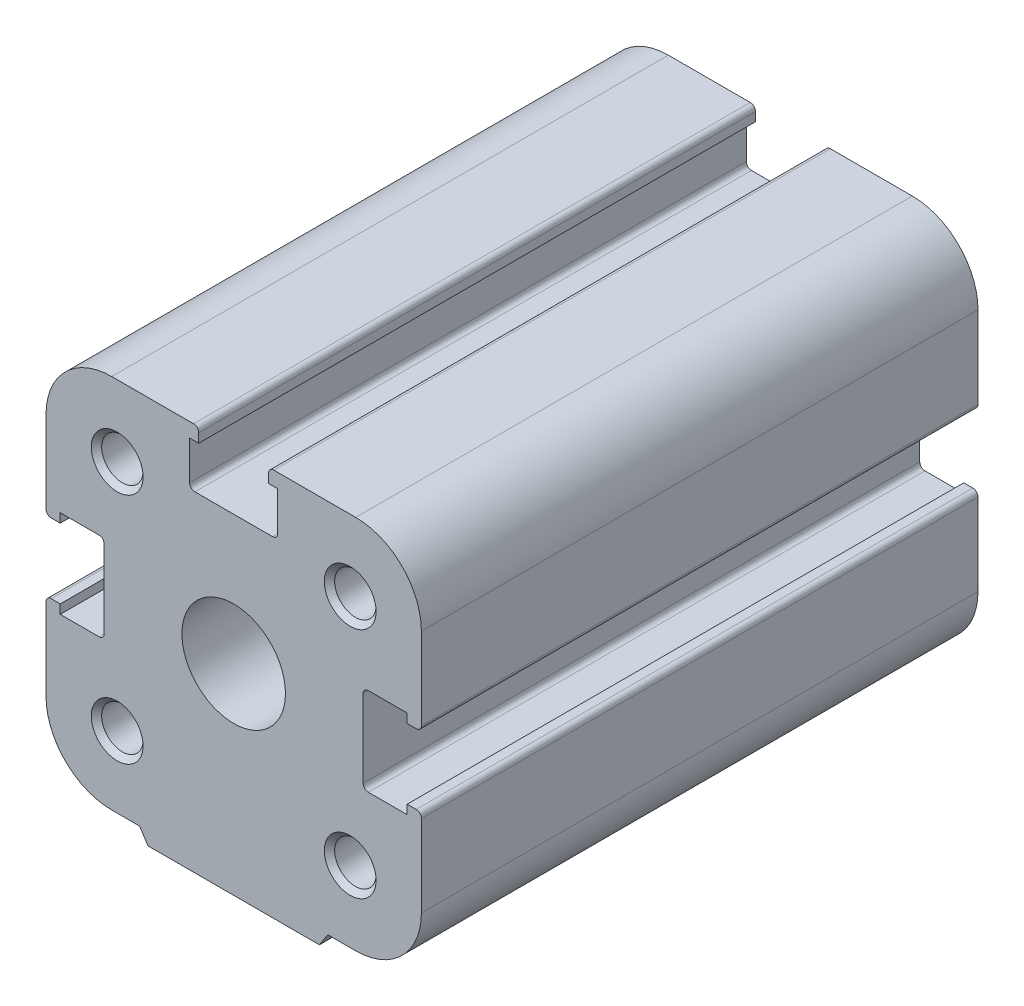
ISO-10303-21;
HEADER;
FILE_DESCRIPTION(('STEP AP214'),'2;1');
FILE_NAME('part.step','',(''),(''),'','','');
FILE_SCHEMA(('AUTOMOTIVE_DESIGN { 1 0 10303 214 1 1 1 1 }'));
ENDSEC;
DATA;
#1=APPLICATION_CONTEXT('core data for automotive mechanical design processes');
#2=APPLICATION_PROTOCOL_DEFINITION('international standard','automotive_design',2000,#1);
#3=PRODUCT_CONTEXT('',#1,'mechanical');
#4=PRODUCT('Part','Part','',(#3));
#5=PRODUCT_RELATED_PRODUCT_CATEGORY('part','',(#4));
#6=PRODUCT_DEFINITION_FORMATION('','',#4);
#7=PRODUCT_DEFINITION_CONTEXT('part definition',#1,'design');
#8=PRODUCT_DEFINITION('design','',#6,#7);
#9=PRODUCT_DEFINITION_SHAPE('','',#8);
#10=(LENGTH_UNIT() NAMED_UNIT(*) SI_UNIT(.MILLI.,.METRE.));
#11=(NAMED_UNIT(*) PLANE_ANGLE_UNIT() SI_UNIT($,.RADIAN.));
#12=(NAMED_UNIT(*) SI_UNIT($,.STERADIAN.) SOLID_ANGLE_UNIT());
#13=UNCERTAINTY_MEASURE_WITH_UNIT(LENGTH_MEASURE(1.E-05),#10,'distance_accuracy_value','');
#14=(GEOMETRIC_REPRESENTATION_CONTEXT(3) GLOBAL_UNCERTAINTY_ASSIGNED_CONTEXT((#13)) GLOBAL_UNIT_ASSIGNED_CONTEXT((#10,
#11,#12)) REPRESENTATION_CONTEXT('',''));
#15=CARTESIAN_POINT('',(0.,0.,0.));
#16=DIRECTION('',(0.,0.,1.));
#17=DIRECTION('',(1.,0.,0.));
#18=AXIS2_PLACEMENT_3D('',#15,#16,#17);
#19=CARTESIAN_POINT('',(0.,4.,-27.));
#20=DIRECTION('',(0.,0.,-1.));
#21=DIRECTION('',(-1.,0.,0.));
#22=AXIS2_PLACEMENT_3D('',#19,#20,#21);
#23=PLANE('',#22);
#24=CARTESIAN_POINT('',(0.,0.,-27.));
#25=DIRECTION('',(0.,0.,1.));
#26=DIRECTION('',(1.,0.,0.));
#27=AXIS2_PLACEMENT_3D('',#24,#25,#26);
#28=CIRCLE('',#27,8.);
#29=CARTESIAN_POINT('',(8.,0.,-27.));
#30=VERTEX_POINT('',#29);
#31=EDGE_CURVE('E21',#30,#30,#28,.T.);
#32=ORIENTED_EDGE('',*,*,#31,.T.);
#33=EDGE_LOOP('',(#32));
#34=FACE_BOUND('',#33,.T.);
#35=ADVANCED_FACE('F17',(#34),#23,.F.);
#36=CARTESIAN_POINT('',(0.,0.,-22.5));
#37=DIRECTION('',(0.,0.,1.));
#38=DIRECTION('',(1.,0.,0.));
#39=AXIS2_PLACEMENT_3D('',#36,#37,#38);
#40=CYLINDRICAL_SURFACE('',#39,8.);
#41=CARTESIAN_POINT('',(0.,0.,-18.));
#42=DIRECTION('',(0.,0.,1.));
#43=DIRECTION('',(1.,0.,0.));
#44=AXIS2_PLACEMENT_3D('',#41,#42,#43);
#45=CIRCLE('',#44,8.);
#46=CARTESIAN_POINT('',(8.,0.,-18.));
#47=VERTEX_POINT('',#46);
#48=EDGE_CURVE('E515',#47,#47,#45,.T.);
#49=ORIENTED_EDGE('',*,*,#48,.T.);
#50=EDGE_LOOP('',(#49));
#51=FACE_BOUND('',#50,.T.);
#52=ORIENTED_EDGE('',*,*,#31,.F.);
#53=EDGE_LOOP('',(#52));
#54=FACE_BOUND('',#53,.T.);
#55=ADVANCED_FACE('F523',(#51,#54),#40,.F.);
#56=CARTESIAN_POINT('',(-9.,9.8,-18.5));
#57=DIRECTION('',(0.,0.,-1.));
#58=DIRECTION('',(-1.,0.,0.));
#59=AXIS2_PLACEMENT_3D('',#56,#57,#58);
#60=PLANE('',#59);
#61=CARTESIAN_POINT('',(-9.,9.,-18.5));
#62=DIRECTION('',(0.,0.,1.));
#63=DIRECTION('',(1.,0.,0.));
#64=AXIS2_PLACEMENT_3D('',#61,#62,#63);
#65=CIRCLE('',#64,1.6);
#66=CARTESIAN_POINT('',(-7.4,9.,-18.5));
#67=VERTEX_POINT('',#66);
#68=EDGE_CURVE('E513',#67,#67,#65,.T.);
#69=ORIENTED_EDGE('',*,*,#68,.T.);
#70=EDGE_LOOP('',(#69));
#71=FACE_BOUND('',#70,.T.);
#72=ADVANCED_FACE('F525',(#71),#60,.F.);
#73=CARTESIAN_POINT('',(-9.,-8.2,-18.5));
#74=DIRECTION('',(0.,0.,-1.));
#75=DIRECTION('',(-1.,0.,0.));
#76=AXIS2_PLACEMENT_3D('',#73,#74,#75);
#77=PLANE('',#76);
#78=CARTESIAN_POINT('',(-9.,-9.,-18.5));
#79=DIRECTION('',(0.,0.,1.));
#80=DIRECTION('',(1.,0.,0.));
#81=AXIS2_PLACEMENT_3D('',#78,#79,#80);
#82=CIRCLE('',#81,1.6);
#83=CARTESIAN_POINT('',(-7.4,-9.,-18.5));
#84=VERTEX_POINT('',#83);
#85=EDGE_CURVE('E510',#84,#84,#82,.T.);
#86=ORIENTED_EDGE('',*,*,#85,.T.);
#87=EDGE_LOOP('',(#86));
#88=FACE_BOUND('',#87,.T.);
#89=ADVANCED_FACE('F532',(#88),#77,.F.);
#90=CARTESIAN_POINT('',(9.,9.8,-18.5));
#91=DIRECTION('',(0.,0.,-1.));
#92=DIRECTION('',(-1.,0.,0.));
#93=AXIS2_PLACEMENT_3D('',#90,#91,#92);
#94=PLANE('',#93);
#95=CARTESIAN_POINT('',(9.,9.,-18.5));
#96=DIRECTION('',(0.,0.,1.));
#97=DIRECTION('',(1.,0.,0.));
#98=AXIS2_PLACEMENT_3D('',#95,#96,#97);
#99=CIRCLE('',#98,1.6);
#100=CARTESIAN_POINT('',(10.6,9.,-18.5));
#101=VERTEX_POINT('',#100);
#102=EDGE_CURVE('E331',#101,#101,#99,.T.);
#103=ORIENTED_EDGE('',*,*,#102,.T.);
#104=EDGE_LOOP('',(#103));
#105=FACE_BOUND('',#104,.T.);
#106=ADVANCED_FACE('F1427',(#105),#94,.F.);
#107=CARTESIAN_POINT('',(9.,-8.2,-18.5));
#108=DIRECTION('',(0.,0.,-1.));
#109=DIRECTION('',(-1.,0.,0.));
#110=AXIS2_PLACEMENT_3D('',#107,#108,#109);
#111=PLANE('',#110);
#112=CARTESIAN_POINT('',(9.,-9.,-18.5));
#113=DIRECTION('',(0.,0.,1.));
#114=DIRECTION('',(1.,0.,0.));
#115=AXIS2_PLACEMENT_3D('',#112,#113,#114);
#116=CIRCLE('',#115,1.6);
#117=CARTESIAN_POINT('',(10.6,-9.,-18.5));
#118=VERTEX_POINT('',#117);
#119=EDGE_CURVE('E325',#118,#118,#116,.T.);
#120=ORIENTED_EDGE('',*,*,#119,.T.);
#121=EDGE_LOOP('',(#120));
#122=FACE_BOUND('',#121,.T.);
#123=ADVANCED_FACE('F318',(#122),#111,.F.);
#124=CARTESIAN_POINT('',(0.,-9.72900000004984,-35.));
#125=DIRECTION('',(0.,-1.,0.));
#126=DIRECTION('',(0.,0.,-1.));
#127=AXIS2_PLACEMENT_3D('',#124,#125,#126);
#128=CONICAL_SURFACE('',#127,2.06700000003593,1.04719755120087);
#129=CARTESIAN_POINT('',(0.,-8.53561699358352,-35.0000000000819));
#130=VERTEX_POINT('',#129);
#131=VERTEX_LOOP('',#130);
#132=FACE_BOUND('',#131,.T.);
#133=CARTESIAN_POINT('',(0.,-9.729,-35.));
#134=DIRECTION('',(0.,1.,0.));
#135=DIRECTION('',(0.,0.,1.));
#136=AXIS2_PLACEMENT_3D('',#133,#134,#135);
#137=CIRCLE('',#136,2.067);
#138=CARTESIAN_POINT('',(0.,-9.729,-32.933));
#139=VERTEX_POINT('',#138);
#140=EDGE_CURVE('E322',#139,#139,#137,.F.);
#141=ORIENTED_EDGE('',*,*,#140,.T.);
#142=EDGE_LOOP('',(#141));
#143=FACE_BOUND('',#142,.T.);
#144=ADVANCED_FACE('F314',(#132,#143),#128,.F.);
#145=CARTESIAN_POINT('',(0.,-8.56900000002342,-8.00000000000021));
#146=DIRECTION('',(0.,-1.,-3.49126737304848E-13));
#147=DIRECTION('',(0.,3.49126737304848E-13,-1.));
#148=AXIS2_PLACEMENT_3D('',#145,#146,#147);
#149=CONICAL_SURFACE('',#148,2.06699999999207,1.04719755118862);
#150=CARTESIAN_POINT('',(0.,-7.37561699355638,-7.99999999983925));
#151=VERTEX_POINT('',#150);
#152=VERTEX_LOOP('',#151);
#153=FACE_BOUND('',#152,.T.);
#154=CARTESIAN_POINT('',(0.,-8.56900000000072,-7.99999999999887));
#155=DIRECTION('',(0.,1.,3.49345077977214E-13));
#156=DIRECTION('',(0.,-3.49345077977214E-13,1.));
#157=AXIS2_PLACEMENT_3D('',#154,#155,#156);
#158=CIRCLE('',#157,2.067);
#159=CARTESIAN_POINT('',(0.,-8.56900000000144,-5.93299999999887));
#160=VERTEX_POINT('',#159);
#161=EDGE_CURVE('E324',#160,#160,#158,.F.);
#162=ORIENTED_EDGE('',*,*,#161,.T.);
#163=EDGE_LOOP('',(#162));
#164=FACE_BOUND('',#163,.T.);
#165=ADVANCED_FACE('F317',(#153,#164),#149,.F.);
#166=CARTESIAN_POINT('',(0.,6.,-18.));
#167=DIRECTION('',(0.,0.,1.));
#168=DIRECTION('',(1.,0.,0.));
#169=AXIS2_PLACEMENT_3D('',#166,#167,#168);
#170=PLANE('',#169);
#171=ORIENTED_EDGE('',*,*,#48,.F.);
#172=EDGE_LOOP('',(#171));
#173=FACE_BOUND('',#172,.T.);
#174=CARTESIAN_POINT('',(0.,0.,-18.));
#175=DIRECTION('',(0.,0.,1.));
#176=DIRECTION('',(1.,0.,0.));
#177=AXIS2_PLACEMENT_3D('',#174,#175,#176);
#178=CIRCLE('',#177,4.);
#179=CARTESIAN_POINT('',(4.,0.,-18.));
#180=VERTEX_POINT('',#179);
#181=EDGE_CURVE('E503',#180,#180,#178,.T.);
#182=ORIENTED_EDGE('',*,*,#181,.T.);
#183=EDGE_LOOP('',(#182));
#184=FACE_BOUND('',#183,.T.);
#185=ADVANCED_FACE('F1418',(#173,#184),#170,.F.);
#186=CARTESIAN_POINT('',(-9.,9.,-9.45));
#187=DIRECTION('',(0.,0.,1.));
#188=DIRECTION('',(1.,0.,0.));
#189=AXIS2_PLACEMENT_3D('',#186,#187,#188);
#190=CYLINDRICAL_SURFACE('',#189,1.6);
#191=CARTESIAN_POINT('',(-9.,9.,-0.400000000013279));
#192=DIRECTION('',(0.,0.,1.));
#193=DIRECTION('',(0.,1.,0.));
#194=AXIS2_PLACEMENT_3D('',#191,#192,#193);
#195=CIRCLE('',#194,1.60000000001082);
#196=CARTESIAN_POINT('',(-9.,10.6000000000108,-0.400000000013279));
#197=VERTEX_POINT('',#196);
#198=EDGE_CURVE('E505',#197,#197,#195,.T.);
#199=ORIENTED_EDGE('',*,*,#198,.T.);
#200=EDGE_LOOP('',(#199));
#201=FACE_BOUND('',#200,.T.);
#202=ORIENTED_EDGE('',*,*,#68,.F.);
#203=EDGE_LOOP('',(#202));
#204=FACE_BOUND('',#203,.T.);
#205=ADVANCED_FACE('F1033',(#201,#204),#190,.F.);
#206=CARTESIAN_POINT('',(-9.,-9.,-9.45));
#207=DIRECTION('',(0.,0.,1.));
#208=DIRECTION('',(1.,0.,0.));
#209=AXIS2_PLACEMENT_3D('',#206,#207,#208);
#210=CYLINDRICAL_SURFACE('',#209,1.6);
#211=CARTESIAN_POINT('',(-9.,-9.,-0.400000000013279));
#212=DIRECTION('',(0.,0.,1.));
#213=DIRECTION('',(0.,1.,0.));
#214=AXIS2_PLACEMENT_3D('',#211,#212,#213);
#215=CIRCLE('',#214,1.59999999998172);
#216=CARTESIAN_POINT('',(-9.,-7.40000000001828,-0.400000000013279));
#217=VERTEX_POINT('',#216);
#218=EDGE_CURVE('E1028',#217,#217,#215,.T.);
#219=ORIENTED_EDGE('',*,*,#218,.T.);
#220=EDGE_LOOP('',(#219));
#221=FACE_BOUND('',#220,.T.);
#222=ORIENTED_EDGE('',*,*,#85,.F.);
#223=EDGE_LOOP('',(#222));
#224=FACE_BOUND('',#223,.T.);
#225=ADVANCED_FACE('F1411',(#221,#224),#210,.F.);
#226=CARTESIAN_POINT('',(9.,9.,-9.45));
#227=DIRECTION('',(0.,0.,1.));
#228=DIRECTION('',(1.,0.,0.));
#229=AXIS2_PLACEMENT_3D('',#226,#227,#228);
#230=CYLINDRICAL_SURFACE('',#229,1.6);
#231=CARTESIAN_POINT('',(9.,9.,-0.400000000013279));
#232=DIRECTION('',(0.,0.,1.));
#233=DIRECTION('',(0.,1.,0.));
#234=AXIS2_PLACEMENT_3D('',#231,#232,#233);
#235=CIRCLE('',#234,1.60000000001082);
#236=CARTESIAN_POINT('',(9.,10.6000000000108,-0.400000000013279));
#237=VERTEX_POINT('',#236);
#238=EDGE_CURVE('E1025',#237,#237,#235,.T.);
#239=ORIENTED_EDGE('',*,*,#238,.T.);
#240=EDGE_LOOP('',(#239));
#241=FACE_BOUND('',#240,.T.);
#242=ORIENTED_EDGE('',*,*,#102,.F.);
#243=EDGE_LOOP('',(#242));
#244=FACE_BOUND('',#243,.T.);
#245=ADVANCED_FACE('F1407',(#241,#244),#230,.F.);
#246=CARTESIAN_POINT('',(9.,-9.,-9.45));
#247=DIRECTION('',(0.,0.,1.));
#248=DIRECTION('',(1.,0.,0.));
#249=AXIS2_PLACEMENT_3D('',#246,#247,#248);
#250=CYLINDRICAL_SURFACE('',#249,1.6);
#251=CARTESIAN_POINT('',(9.,-9.,-0.400000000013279));
#252=DIRECTION('',(0.,0.,1.));
#253=DIRECTION('',(0.,1.,0.));
#254=AXIS2_PLACEMENT_3D('',#251,#252,#253);
#255=CIRCLE('',#254,1.59999999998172);
#256=CARTESIAN_POINT('',(9.,-7.40000000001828,-0.400000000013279));
#257=VERTEX_POINT('',#256);
#258=EDGE_CURVE('E502',#257,#257,#255,.T.);
#259=ORIENTED_EDGE('',*,*,#258,.T.);
#260=EDGE_LOOP('',(#259));
#261=FACE_BOUND('',#260,.T.);
#262=ORIENTED_EDGE('',*,*,#119,.F.);
#263=EDGE_LOOP('',(#262));
#264=FACE_BOUND('',#263,.T.);
#265=ADVANCED_FACE('F1403',(#261,#264),#250,.F.);
#266=CARTESIAN_POINT('',(-9.,9.8,-24.5));
#267=DIRECTION('',(0.,0.,1.));
#268=DIRECTION('',(1.,0.,0.));
#269=AXIS2_PLACEMENT_3D('',#266,#267,#268);
#270=PLANE('',#269);
#271=CARTESIAN_POINT('',(-9.,9.,-24.5));
#272=DIRECTION('',(0.,0.,1.));
#273=DIRECTION('',(1.,0.,0.));
#274=AXIS2_PLACEMENT_3D('',#271,#272,#273);
#275=CIRCLE('',#274,1.6);
#276=CARTESIAN_POINT('',(-7.4,9.,-24.5));
#277=VERTEX_POINT('',#276);
#278=EDGE_CURVE('E499',#277,#277,#275,.F.);
#279=ORIENTED_EDGE('',*,*,#278,.T.);
#280=EDGE_LOOP('',(#279));
#281=FACE_BOUND('',#280,.T.);
#282=ADVANCED_FACE('F1399',(#281),#270,.F.);
#283=CARTESIAN_POINT('',(-9.,-8.2,-24.5));
#284=DIRECTION('',(0.,0.,1.));
#285=DIRECTION('',(1.,0.,0.));
#286=AXIS2_PLACEMENT_3D('',#283,#284,#285);
#287=PLANE('',#286);
#288=CARTESIAN_POINT('',(-9.,-9.,-24.5));
#289=DIRECTION('',(0.,0.,1.));
#290=DIRECTION('',(1.,0.,0.));
#291=AXIS2_PLACEMENT_3D('',#288,#289,#290);
#292=CIRCLE('',#291,1.6);
#293=CARTESIAN_POINT('',(-7.4,-9.,-24.5));
#294=VERTEX_POINT('',#293);
#295=EDGE_CURVE('E496',#294,#294,#292,.F.);
#296=ORIENTED_EDGE('',*,*,#295,.T.);
#297=EDGE_LOOP('',(#296));
#298=FACE_BOUND('',#297,.T.);
#299=ADVANCED_FACE('F1395',(#298),#287,.F.);
#300=CARTESIAN_POINT('',(9.,9.8,-24.5));
#301=DIRECTION('',(0.,0.,1.));
#302=DIRECTION('',(1.,0.,0.));
#303=AXIS2_PLACEMENT_3D('',#300,#301,#302);
#304=PLANE('',#303);
#305=CARTESIAN_POINT('',(9.,9.,-24.5));
#306=DIRECTION('',(0.,0.,1.));
#307=DIRECTION('',(1.,0.,0.));
#308=AXIS2_PLACEMENT_3D('',#305,#306,#307);
#309=CIRCLE('',#308,1.6);
#310=CARTESIAN_POINT('',(10.6,9.,-24.5));
#311=VERTEX_POINT('',#310);
#312=EDGE_CURVE('E493',#311,#311,#309,.F.);
#313=ORIENTED_EDGE('',*,*,#312,.T.);
#314=EDGE_LOOP('',(#313));
#315=FACE_BOUND('',#314,.T.);
#316=ADVANCED_FACE('F1391',(#315),#304,.F.);
#317=CARTESIAN_POINT('',(9.,-8.2,-24.5));
#318=DIRECTION('',(0.,0.,1.));
#319=DIRECTION('',(1.,0.,0.));
#320=AXIS2_PLACEMENT_3D('',#317,#318,#319);
#321=PLANE('',#320);
#322=CARTESIAN_POINT('',(9.,-9.,-24.5));
#323=DIRECTION('',(0.,0.,1.));
#324=DIRECTION('',(1.,0.,0.));
#325=AXIS2_PLACEMENT_3D('',#322,#323,#324);
#326=CIRCLE('',#325,1.6);
#327=CARTESIAN_POINT('',(10.6,-9.,-24.5));
#328=VERTEX_POINT('',#327);
#329=EDGE_CURVE('E489',#328,#328,#326,.F.);
#330=ORIENTED_EDGE('',*,*,#329,.T.);
#331=EDGE_LOOP('',(#330));
#332=FACE_BOUND('',#331,.T.);
#333=ADVANCED_FACE('F1387',(#332),#321,.F.);
#334=CARTESIAN_POINT('',(0.,-12.398,-35.));
#335=DIRECTION('',(0.,1.,0.));
#336=DIRECTION('',(0.,0.,1.));
#337=AXIS2_PLACEMENT_3D('',#334,#335,#336);
#338=CYLINDRICAL_SURFACE('',#337,2.067);
#339=CARTESIAN_POINT('',(0.,-15.0669999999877,-35.));
#340=DIRECTION('',(0.,-1.,0.));
#341=DIRECTION('',(0.,0.,-1.));
#342=AXIS2_PLACEMENT_3D('',#339,#340,#341);
#343=CIRCLE('',#342,2.06699999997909);
#344=CARTESIAN_POINT('',(0.,-15.0669999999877,-37.0669999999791));
#345=VERTEX_POINT('',#344);
#346=EDGE_CURVE('E492',#345,#345,#343,.T.);
#347=ORIENTED_EDGE('',*,*,#346,.T.);
#348=EDGE_LOOP('',(#347));
#349=FACE_BOUND('',#348,.T.);
#350=ORIENTED_EDGE('',*,*,#140,.F.);
#351=EDGE_LOOP('',(#350));
#352=FACE_BOUND('',#351,.T.);
#353=ADVANCED_FACE('F1383',(#349,#352),#338,.F.);
#354=CARTESIAN_POINT('',(0.,-11.818,-8.));
#355=DIRECTION('',(0.,1.,3.49345077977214E-13));
#356=DIRECTION('',(0.,-3.49345077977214E-13,1.));
#357=AXIS2_PLACEMENT_3D('',#354,#355,#356);
#358=CYLINDRICAL_SURFACE('',#357,2.067);
#359=CARTESIAN_POINT('',(0.,-15.0669999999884,-7.99999999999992));
#360=DIRECTION('',(0.,-1.,-3.49345077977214E-13));
#361=DIRECTION('',(0.,3.49126737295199E-13,-1.));
#362=AXIS2_PLACEMENT_3D('',#359,#360,#361);
#363=CIRCLE('',#362,2.0670000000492);
#364=CARTESIAN_POINT('',(0.,-15.0669999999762,-10.0670000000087));
#365=VERTEX_POINT('',#364);
#366=CARTESIAN_POINT('',(0.,-15.0669999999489,-5.93299999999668));
#367=VERTEX_POINT('',#366);
#368=EDGE_CURVE('E897',#365,#367,#363,.T.);
#369=ORIENTED_EDGE('',*,*,#368,.T.);
#370=CARTESIAN_POINT('',(0.,-15.0669999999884,-7.99999999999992));
#371=DIRECTION('',(0.,-1.,-3.49345077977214E-13));
#372=DIRECTION('',(0.,3.49126737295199E-13,-1.));
#373=AXIS2_PLACEMENT_3D('',#370,#371,#372);
#374=CIRCLE('',#373,2.0670000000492);
#375=EDGE_CURVE('E1012',#367,#365,#374,.T.);
#376=ORIENTED_EDGE('',*,*,#375,.T.);
#377=EDGE_LOOP('',(#369,#376));
#378=FACE_BOUND('',#377,.T.);
#379=ORIENTED_EDGE('',*,*,#161,.F.);
#380=EDGE_LOOP('',(#379));
#381=FACE_BOUND('',#380,.T.);
#382=ADVANCED_FACE('F1380',(#378,#381),#358,.F.);
#383=CARTESIAN_POINT('',(14.1,-2.70000000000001,0.));
#384=DIRECTION('',(0.,1.,0.));
#385=DIRECTION('',(-1.,0.,0.));
#386=AXIS2_PLACEMENT_3D('',#383,#384,#385);
#387=PLANE('',#386);
#388=DIRECTION('',(-1.,0.,0.));
#389=VECTOR('',#388,1.);
#390=CARTESIAN_POINT('',(14.1,-2.70000000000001,0.));
#391=LINE('',#390,#389);
#392=CARTESIAN_POINT('',(13.4,-2.70000000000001,0.));
#393=VERTEX_POINT('',#392);
#394=CARTESIAN_POINT('',(14.1,-2.70000000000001,0.));
#395=VERTEX_POINT('',#394);
#396=EDGE_CURVE('E1003',#393,#395,#391,.F.);
#397=ORIENTED_EDGE('',*,*,#396,.T.);
#398=DIRECTION('',(0.,0.,-1.));
#399=VECTOR('',#398,1.);
#400=CARTESIAN_POINT('',(14.1,-2.70000000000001,0.));
#401=LINE('',#400,#399);
#402=CARTESIAN_POINT('',(14.1,-2.70000000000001,-43.));
#403=VERTEX_POINT('',#402);
#404=EDGE_CURVE('E487',#403,#395,#401,.F.);
#405=ORIENTED_EDGE('',*,*,#404,.F.);
#406=DIRECTION('',(-1.,0.,0.));
#407=VECTOR('',#406,1.);
#408=CARTESIAN_POINT('',(14.1,-2.70000000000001,-43.));
#409=LINE('',#408,#407);
#410=CARTESIAN_POINT('',(13.4,-2.70000000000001,-43.));
#411=VERTEX_POINT('',#410);
#412=EDGE_CURVE('E328',#403,#411,#409,.T.);
#413=ORIENTED_EDGE('',*,*,#412,.T.);
#414=DIRECTION('',(0.,0.,1.));
#415=VECTOR('',#414,1.);
#416=CARTESIAN_POINT('',(13.4,-2.70000000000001,0.));
#417=LINE('',#416,#415);
#418=EDGE_CURVE('E485',#393,#411,#417,.F.);
#419=ORIENTED_EDGE('',*,*,#418,.F.);
#420=EDGE_LOOP('',(#397,#405,#413,#419));
#421=FACE_BOUND('',#420,.T.);
#422=ADVANCED_FACE('F1248',(#421),#387,.T.);
#423=CARTESIAN_POINT('',(13.4,2.7,0.));
#424=DIRECTION('',(0.,-1.,0.));
#425=DIRECTION('',(0.,0.,-1.));
#426=AXIS2_PLACEMENT_3D('',#423,#424,#425);
#427=PLANE('',#426);
#428=DIRECTION('',(1.,0.,0.));
#429=VECTOR('',#428,1.);
#430=CARTESIAN_POINT('',(13.4,2.7,0.));
#431=LINE('',#430,#429);
#432=CARTESIAN_POINT('',(14.1,2.7,0.));
#433=VERTEX_POINT('',#432);
#434=CARTESIAN_POINT('',(13.4,2.7,0.));
#435=VERTEX_POINT('',#434);
#436=EDGE_CURVE('E995',#433,#435,#431,.F.);
#437=ORIENTED_EDGE('',*,*,#436,.T.);
#438=DIRECTION('',(0.,0.,1.));
#439=VECTOR('',#438,1.);
#440=CARTESIAN_POINT('',(13.4,2.7,0.));
#441=LINE('',#440,#439);
#442=CARTESIAN_POINT('',(13.4,2.7,-43.));
#443=VERTEX_POINT('',#442);
#444=EDGE_CURVE('E481',#443,#435,#441,.T.);
#445=ORIENTED_EDGE('',*,*,#444,.F.);
#446=DIRECTION('',(1.,0.,0.));
#447=VECTOR('',#446,1.);
#448=CARTESIAN_POINT('',(13.4,2.7,-43.));
#449=LINE('',#448,#447);
#450=CARTESIAN_POINT('',(14.1,2.7,-43.));
#451=VERTEX_POINT('',#450);
#452=EDGE_CURVE('E999',#443,#451,#449,.T.);
#453=ORIENTED_EDGE('',*,*,#452,.T.);
#454=DIRECTION('',(0.,0.,-1.));
#455=VECTOR('',#454,1.);
#456=CARTESIAN_POINT('',(14.1,2.70000000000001,0.));
#457=LINE('',#456,#455);
#458=EDGE_CURVE('E476',#433,#451,#457,.T.);
#459=ORIENTED_EDGE('',*,*,#458,.F.);
#460=EDGE_LOOP('',(#437,#445,#453,#459));
#461=FACE_BOUND('',#460,.T.);
#462=ADVANCED_FACE('F1271',(#461),#427,.T.);
#463=CARTESIAN_POINT('',(2.7,14.1,0.));
#464=DIRECTION('',(-1.,0.,0.));
#465=DIRECTION('',(0.,-1.,0.));
#466=AXIS2_PLACEMENT_3D('',#463,#464,#465);
#467=PLANE('',#466);
#468=DIRECTION('',(0.,-1.,0.));
#469=VECTOR('',#468,1.);
#470=CARTESIAN_POINT('',(2.7,14.1,0.));
#471=LINE('',#470,#469);
#472=CARTESIAN_POINT('',(2.7,13.4,0.));
#473=VERTEX_POINT('',#472);
#474=CARTESIAN_POINT('',(2.7,14.1,0.));
#475=VERTEX_POINT('',#474);
#476=EDGE_CURVE('E987',#473,#475,#471,.F.);
#477=ORIENTED_EDGE('',*,*,#476,.T.);
#478=DIRECTION('',(0.,0.,-1.));
#479=VECTOR('',#478,1.);
#480=CARTESIAN_POINT('',(2.7,14.1,0.));
#481=LINE('',#480,#479);
#482=CARTESIAN_POINT('',(2.7,14.1,-43.));
#483=VERTEX_POINT('',#482);
#484=EDGE_CURVE('E475',#483,#475,#481,.F.);
#485=ORIENTED_EDGE('',*,*,#484,.F.);
#486=DIRECTION('',(0.,-1.,0.));
#487=VECTOR('',#486,1.);
#488=CARTESIAN_POINT('',(2.7,14.1,-43.));
#489=LINE('',#488,#487);
#490=CARTESIAN_POINT('',(2.7,13.4,-43.));
#491=VERTEX_POINT('',#490);
#492=EDGE_CURVE('E991',#483,#491,#489,.T.);
#493=ORIENTED_EDGE('',*,*,#492,.T.);
#494=DIRECTION('',(0.,0.,-1.));
#495=VECTOR('',#494,1.);
#496=CARTESIAN_POINT('',(2.7,13.4,0.));
#497=LINE('',#496,#495);
#498=EDGE_CURVE('E472',#473,#491,#497,.T.);
#499=ORIENTED_EDGE('',*,*,#498,.F.);
#500=EDGE_LOOP('',(#477,#485,#493,#499));
#501=FACE_BOUND('',#500,.T.);
#502=ADVANCED_FACE('F1286',(#501),#467,.T.);
#503=CARTESIAN_POINT('',(-2.7,13.4,0.));
#504=DIRECTION('',(1.,0.,0.));
#505=DIRECTION('',(0.,0.,-1.));
#506=AXIS2_PLACEMENT_3D('',#503,#504,#505);
#507=PLANE('',#506);
#508=DIRECTION('',(0.,1.,0.));
#509=VECTOR('',#508,1.);
#510=CARTESIAN_POINT('',(-2.7,13.4,0.));
#511=LINE('',#510,#509);
#512=CARTESIAN_POINT('',(-2.7,14.1,0.));
#513=VERTEX_POINT('',#512);
#514=CARTESIAN_POINT('',(-2.7,13.4,0.));
#515=VERTEX_POINT('',#514);
#516=EDGE_CURVE('E979',#513,#515,#511,.F.);
#517=ORIENTED_EDGE('',*,*,#516,.T.);
#518=DIRECTION('',(0.,0.,-1.));
#519=VECTOR('',#518,1.);
#520=CARTESIAN_POINT('',(-2.7,13.4,0.));
#521=LINE('',#520,#519);
#522=CARTESIAN_POINT('',(-2.7,13.4,-43.));
#523=VERTEX_POINT('',#522);
#524=EDGE_CURVE('E468',#523,#515,#521,.F.);
#525=ORIENTED_EDGE('',*,*,#524,.F.);
#526=DIRECTION('',(0.,1.,0.));
#527=VECTOR('',#526,1.);
#528=CARTESIAN_POINT('',(-2.7,13.4,-43.));
#529=LINE('',#528,#527);
#530=CARTESIAN_POINT('',(-2.7,14.1,-43.));
#531=VERTEX_POINT('',#530);
#532=EDGE_CURVE('E983',#523,#531,#529,.T.);
#533=ORIENTED_EDGE('',*,*,#532,.T.);
#534=DIRECTION('',(0.,0.,-1.));
#535=VECTOR('',#534,1.);
#536=CARTESIAN_POINT('',(-2.7,14.1,0.));
#537=LINE('',#536,#535);
#538=EDGE_CURVE('E463',#513,#531,#537,.T.);
#539=ORIENTED_EDGE('',*,*,#538,.F.);
#540=EDGE_LOOP('',(#517,#525,#533,#539));
#541=FACE_BOUND('',#540,.T.);
#542=ADVANCED_FACE('F1341',(#541),#507,.T.);
#543=CARTESIAN_POINT('',(-14.1,2.70000000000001,0.));
#544=DIRECTION('',(0.,-1.,0.));
#545=DIRECTION('',(1.,0.,0.));
#546=AXIS2_PLACEMENT_3D('',#543,#544,#545);
#547=PLANE('',#546);
#548=DIRECTION('',(1.,0.,0.));
#549=VECTOR('',#548,1.);
#550=CARTESIAN_POINT('',(-14.1,2.70000000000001,0.));
#551=LINE('',#550,#549);
#552=CARTESIAN_POINT('',(-13.4,2.70000000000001,0.));
#553=VERTEX_POINT('',#552);
#554=CARTESIAN_POINT('',(-14.1,2.70000000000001,0.));
#555=VERTEX_POINT('',#554);
#556=EDGE_CURVE('E971',#553,#555,#551,.F.);
#557=ORIENTED_EDGE('',*,*,#556,.T.);
#558=DIRECTION('',(0.,0.,-1.));
#559=VECTOR('',#558,1.);
#560=CARTESIAN_POINT('',(-14.1,2.70000000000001,0.));
#561=LINE('',#560,#559);
#562=CARTESIAN_POINT('',(-14.1,2.70000000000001,-43.));
#563=VERTEX_POINT('',#562);
#564=EDGE_CURVE('E462',#563,#555,#561,.F.);
#565=ORIENTED_EDGE('',*,*,#564,.F.);
#566=DIRECTION('',(1.,0.,0.));
#567=VECTOR('',#566,1.);
#568=CARTESIAN_POINT('',(-14.1,2.70000000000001,-43.));
#569=LINE('',#568,#567);
#570=CARTESIAN_POINT('',(-13.4,2.7,-43.));
#571=VERTEX_POINT('',#570);
#572=EDGE_CURVE('E975',#563,#571,#569,.T.);
#573=ORIENTED_EDGE('',*,*,#572,.T.);
#574=DIRECTION('',(0.,0.,-1.));
#575=VECTOR('',#574,1.);
#576=CARTESIAN_POINT('',(-13.4,2.7,0.));
#577=LINE('',#576,#575);
#578=EDGE_CURVE('E459',#553,#571,#577,.T.);
#579=ORIENTED_EDGE('',*,*,#578,.F.);
#580=EDGE_LOOP('',(#557,#565,#573,#579));
#581=FACE_BOUND('',#580,.T.);
#582=ADVANCED_FACE('F1355',(#581),#547,.T.);
#583=CARTESIAN_POINT('',(-13.4,-2.7,0.));
#584=DIRECTION('',(0.,1.,0.));
#585=DIRECTION('',(0.,0.,1.));
#586=AXIS2_PLACEMENT_3D('',#583,#584,#585);
#587=PLANE('',#586);
#588=DIRECTION('',(1.,0.,0.));
#589=VECTOR('',#588,1.);
#590=CARTESIAN_POINT('',(-13.4,-2.7,0.));
#591=LINE('',#590,#589);
#592=CARTESIAN_POINT('',(-14.1,-2.7,0.));
#593=VERTEX_POINT('',#592);
#594=CARTESIAN_POINT('',(-13.4,-2.7,0.));
#595=VERTEX_POINT('',#594);
#596=EDGE_CURVE('E506',#593,#595,#591,.T.);
#597=ORIENTED_EDGE('',*,*,#596,.T.);
#598=DIRECTION('',(0.,0.,-1.));
#599=VECTOR('',#598,1.);
#600=CARTESIAN_POINT('',(-13.4,-2.7,0.));
#601=LINE('',#600,#599);
#602=CARTESIAN_POINT('',(-13.4,-2.7,-43.));
#603=VERTEX_POINT('',#602);
#604=EDGE_CURVE('E455',#603,#595,#601,.F.);
#605=ORIENTED_EDGE('',*,*,#604,.F.);
#606=DIRECTION('',(1.,0.,0.));
#607=VECTOR('',#606,1.);
#608=CARTESIAN_POINT('',(-13.4,-2.7,-43.));
#609=LINE('',#608,#607);
#610=CARTESIAN_POINT('',(-14.1,-2.7,-43.));
#611=VERTEX_POINT('',#610);
#612=EDGE_CURVE('E967',#603,#611,#609,.F.);
#613=ORIENTED_EDGE('',*,*,#612,.T.);
#614=DIRECTION('',(0.,0.,-1.));
#615=VECTOR('',#614,1.);
#616=CARTESIAN_POINT('',(-14.1,-2.7,0.));
#617=LINE('',#616,#615);
#618=EDGE_CURVE('E452',#593,#611,#617,.T.);
#619=ORIENTED_EDGE('',*,*,#618,.F.);
#620=EDGE_LOOP('',(#597,#605,#613,#619));
#621=FACE_BOUND('',#620,.T.);
#622=ADVANCED_FACE('F1049',(#621),#587,.T.);
#623=CARTESIAN_POINT('',(0.,0.,-9.));
#624=DIRECTION('',(0.,0.,1.));
#625=DIRECTION('',(1.,0.,0.));
#626=AXIS2_PLACEMENT_3D('',#623,#624,#625);
#627=CYLINDRICAL_SURFACE('',#626,4.);
#628=CARTESIAN_POINT('',(0.,0.,0.));
#629=DIRECTION('',(0.,0.,1.));
#630=DIRECTION('',(1.,0.,0.));
#631=AXIS2_PLACEMENT_3D('',#628,#629,#630);
#632=CIRCLE('',#631,4.);
#633=CARTESIAN_POINT('',(4.,0.,0.));
#634=VERTEX_POINT('',#633);
#635=EDGE_CURVE('E446',#634,#634,#632,.F.);
#636=ORIENTED_EDGE('',*,*,#635,.F.);
#637=EDGE_LOOP('',(#636));
#638=FACE_BOUND('',#637,.T.);
#639=ORIENTED_EDGE('',*,*,#181,.F.);
#640=EDGE_LOOP('',(#639));
#641=FACE_BOUND('',#640,.T.);
#642=ADVANCED_FACE('F1039',(#638,#641),#627,.F.);
#643=CARTESIAN_POINT('',(-9.,9.,0.));
#644=DIRECTION('',(0.,0.,1.));
#645=DIRECTION('',(1.,0.,0.));
#646=AXIS2_PLACEMENT_3D('',#643,#644,#645);
#647=CONICAL_SURFACE('',#646,2.0000000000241,0.785398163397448);
#648=CARTESIAN_POINT('',(-9.,9.,0.));
#649=DIRECTION('',(0.,0.,1.));
#650=DIRECTION('',(1.,0.,0.));
#651=AXIS2_PLACEMENT_3D('',#648,#649,#650);
#652=CIRCLE('',#651,2.0000000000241);
#653=CARTESIAN_POINT('',(-6.9999999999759,9.,0.));
#654=VERTEX_POINT('',#653);
#655=EDGE_CURVE('E443',#654,#654,#652,.F.);
#656=ORIENTED_EDGE('',*,*,#655,.F.);
#657=EDGE_LOOP('',(#656));
#658=FACE_BOUND('',#657,.T.);
#659=ORIENTED_EDGE('',*,*,#198,.F.);
#660=EDGE_LOOP('',(#659));
#661=FACE_BOUND('',#660,.T.);
#662=ADVANCED_FACE('F1036',(#658,#661),#647,.F.);
#663=CARTESIAN_POINT('',(-9.,-9.,5.6843418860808E-11));
#664=DIRECTION('',(0.,0.,1.));
#665=DIRECTION('',(1.,0.,0.));
#666=AXIS2_PLACEMENT_3D('',#663,#664,#665);
#667=CONICAL_SURFACE('',#666,2.00000000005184,0.785398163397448);
#668=CARTESIAN_POINT('',(-9.,-9.,5.6843418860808E-11));
#669=DIRECTION('',(0.,0.,1.));
#670=DIRECTION('',(1.,0.,0.));
#671=AXIS2_PLACEMENT_3D('',#668,#669,#670);
#672=CIRCLE('',#671,2.00000000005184);
#673=CARTESIAN_POINT('',(-6.99999999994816,-9.,5.6843418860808E-11));
#674=VERTEX_POINT('',#673);
#675=EDGE_CURVE('E440',#674,#674,#672,.F.);
#676=ORIENTED_EDGE('',*,*,#675,.F.);
#677=EDGE_LOOP('',(#676));
#678=FACE_BOUND('',#677,.T.);
#679=ORIENTED_EDGE('',*,*,#218,.F.);
#680=EDGE_LOOP('',(#679));
#681=FACE_BOUND('',#680,.T.);
#682=ADVANCED_FACE('F1038',(#678,#681),#667,.F.);
#683=CARTESIAN_POINT('',(9.,9.,0.));
#684=DIRECTION('',(0.,0.,1.));
#685=DIRECTION('',(1.,0.,0.));
#686=AXIS2_PLACEMENT_3D('',#683,#684,#685);
#687=CONICAL_SURFACE('',#686,2.0000000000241,0.785398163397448);
#688=CARTESIAN_POINT('',(9.,9.,0.));
#689=DIRECTION('',(0.,0.,1.));
#690=DIRECTION('',(1.,0.,0.));
#691=AXIS2_PLACEMENT_3D('',#688,#689,#690);
#692=CIRCLE('',#691,2.0000000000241);
#693=CARTESIAN_POINT('',(11.0000000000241,9.,0.));
#694=VERTEX_POINT('',#693);
#695=EDGE_CURVE('E437',#694,#694,#692,.F.);
#696=ORIENTED_EDGE('',*,*,#695,.F.);
#697=EDGE_LOOP('',(#696));
#698=FACE_BOUND('',#697,.T.);
#699=ORIENTED_EDGE('',*,*,#238,.F.);
#700=EDGE_LOOP('',(#699));
#701=FACE_BOUND('',#700,.T.);
#702=ADVANCED_FACE('F1046',(#698,#701),#687,.F.);
#703=CARTESIAN_POINT('',(9.,-9.,5.6843418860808E-11));
#704=DIRECTION('',(0.,0.,1.));
#705=DIRECTION('',(1.,0.,0.));
#706=AXIS2_PLACEMENT_3D('',#703,#704,#705);
#707=CONICAL_SURFACE('',#706,2.00000000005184,0.785398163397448);
#708=CARTESIAN_POINT('',(9.,-9.,5.6843418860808E-11));
#709=DIRECTION('',(0.,0.,1.));
#710=DIRECTION('',(1.,0.,0.));
#711=AXIS2_PLACEMENT_3D('',#708,#709,#710);
#712=CIRCLE('',#711,2.00000000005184);
#713=CARTESIAN_POINT('',(11.0000000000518,-9.,5.6843418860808E-11));
#714=VERTEX_POINT('',#713);
#715=EDGE_CURVE('E433',#714,#714,#712,.F.);
#716=ORIENTED_EDGE('',*,*,#715,.F.);
#717=EDGE_LOOP('',(#716));
#718=FACE_BOUND('',#717,.T.);
#719=ORIENTED_EDGE('',*,*,#258,.F.);
#720=EDGE_LOOP('',(#719));
#721=FACE_BOUND('',#720,.T.);
#722=ADVANCED_FACE('F1057',(#718,#721),#707,.F.);
#723=CARTESIAN_POINT('',(-9.,9.,-33.55));
#724=DIRECTION('',(0.,0.,1.));
#725=DIRECTION('',(1.,0.,0.));
#726=AXIS2_PLACEMENT_3D('',#723,#724,#725);
#727=CYLINDRICAL_SURFACE('',#726,1.6);
#728=ORIENTED_EDGE('',*,*,#278,.F.);
#729=EDGE_LOOP('',(#728));
#730=FACE_BOUND('',#729,.T.);
#731=CARTESIAN_POINT('',(-9.,9.,-42.5999999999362));
#732=DIRECTION('',(0.,0.,-1.));
#733=DIRECTION('',(0.,1.,0.));
#734=AXIS2_PLACEMENT_3D('',#731,#732,#733);
#735=CIRCLE('',#734,1.60000000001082);
#736=CARTESIAN_POINT('',(-9.,10.6000000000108,-42.5999999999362));
#737=VERTEX_POINT('',#736);
#738=EDGE_CURVE('E400',#737,#737,#735,.T.);
#739=ORIENTED_EDGE('',*,*,#738,.T.);
#740=EDGE_LOOP('',(#739));
#741=FACE_BOUND('',#740,.T.);
#742=ADVANCED_FACE('F1061',(#730,#741),#727,.F.);
#743=CARTESIAN_POINT('',(-9.,-9.,-33.55));
#744=DIRECTION('',(0.,0.,1.));
#745=DIRECTION('',(1.,0.,0.));
#746=AXIS2_PLACEMENT_3D('',#743,#744,#745);
#747=CYLINDRICAL_SURFACE('',#746,1.6);
#748=ORIENTED_EDGE('',*,*,#295,.F.);
#749=EDGE_LOOP('',(#748));
#750=FACE_BOUND('',#749,.T.);
#751=CARTESIAN_POINT('',(-9.,-9.,-42.5999999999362));
#752=DIRECTION('',(0.,0.,-1.));
#753=DIRECTION('',(0.,1.,0.));
#754=AXIS2_PLACEMENT_3D('',#751,#752,#753);
#755=CIRCLE('',#754,1.59999999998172);
#756=CARTESIAN_POINT('',(-9.,-7.40000000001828,-42.5999999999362));
#757=VERTEX_POINT('',#756);
#758=EDGE_CURVE('E909',#757,#757,#755,.T.);
#759=ORIENTED_EDGE('',*,*,#758,.T.);
#760=EDGE_LOOP('',(#759));
#761=FACE_BOUND('',#760,.T.);
#762=ADVANCED_FACE('F1065',(#750,#761),#747,.F.);
#763=CARTESIAN_POINT('',(9.,9.,-33.55));
#764=DIRECTION('',(0.,0.,1.));
#765=DIRECTION('',(1.,0.,0.));
#766=AXIS2_PLACEMENT_3D('',#763,#764,#765);
#767=CYLINDRICAL_SURFACE('',#766,1.6);
#768=ORIENTED_EDGE('',*,*,#312,.F.);
#769=EDGE_LOOP('',(#768));
#770=FACE_BOUND('',#769,.T.);
#771=CARTESIAN_POINT('',(9.,9.,-42.5999999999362));
#772=DIRECTION('',(0.,0.,-1.));
#773=DIRECTION('',(0.,1.,0.));
#774=AXIS2_PLACEMENT_3D('',#771,#772,#773);
#775=CIRCLE('',#774,1.60000000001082);
#776=CARTESIAN_POINT('',(9.,10.6000000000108,-42.5999999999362));
#777=VERTEX_POINT('',#776);
#778=EDGE_CURVE('E906',#777,#777,#775,.T.);
#779=ORIENTED_EDGE('',*,*,#778,.T.);
#780=EDGE_LOOP('',(#779));
#781=FACE_BOUND('',#780,.T.);
#782=ADVANCED_FACE('F1069',(#770,#781),#767,.F.);
#783=CARTESIAN_POINT('',(9.,-9.,-33.55));
#784=DIRECTION('',(0.,0.,1.));
#785=DIRECTION('',(1.,0.,0.));
#786=AXIS2_PLACEMENT_3D('',#783,#784,#785);
#787=CYLINDRICAL_SURFACE('',#786,1.6);
#788=ORIENTED_EDGE('',*,*,#329,.F.);
#789=EDGE_LOOP('',(#788));
#790=FACE_BOUND('',#789,.T.);
#791=CARTESIAN_POINT('',(9.,-9.,-42.5999999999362));
#792=DIRECTION('',(0.,0.,-1.));
#793=DIRECTION('',(0.,1.,0.));
#794=AXIS2_PLACEMENT_3D('',#791,#792,#793);
#795=CIRCLE('',#794,1.59999999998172);
#796=CARTESIAN_POINT('',(9.,-7.40000000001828,-42.5999999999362));
#797=VERTEX_POINT('',#796);
#798=EDGE_CURVE('E397',#797,#797,#795,.T.);
#799=ORIENTED_EDGE('',*,*,#798,.T.);
#800=EDGE_LOOP('',(#799));
#801=FACE_BOUND('',#800,.T.);
#802=ADVANCED_FACE('F1073',(#790,#801),#787,.F.);
#803=CARTESIAN_POINT('',(0.,1.5,-39.));
#804=DIRECTION('',(0.,0.,1.));
#805=DIRECTION('',(1.,0.,0.));
#806=AXIS2_PLACEMENT_3D('',#803,#804,#805);
#807=PLANE('',#806);
#808=CARTESIAN_POINT('',(0.,0.,-39.));
#809=DIRECTION('',(0.,0.,1.));
#810=DIRECTION('',(1.,0.,0.));
#811=AXIS2_PLACEMENT_3D('',#808,#809,#810);
#812=CIRCLE('',#811,3.);
#813=CARTESIAN_POINT('',(3.,0.,-39.));
#814=VERTEX_POINT('',#813);
#815=EDGE_CURVE('E394',#814,#814,#812,.F.);
#816=ORIENTED_EDGE('',*,*,#815,.T.);
#817=EDGE_LOOP('',(#816));
#818=FACE_BOUND('',#817,.T.);
#819=ADVANCED_FACE('F1077',(#818),#807,.F.);
#820=CARTESIAN_POINT('',(0.,-15.5000000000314,-35.));
#821=DIRECTION('',(0.,-1.,0.));
#822=DIRECTION('',(1.,0.,0.));
#823=AXIS2_PLACEMENT_3D('',#820,#821,#822);
#824=CONICAL_SURFACE('',#823,2.50000000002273,0.785398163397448);
#825=CARTESIAN_POINT('',(0.,-15.5000000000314,-35.));
#826=DIRECTION('',(0.,-1.,0.));
#827=DIRECTION('',(1.,0.,0.));
#828=AXIS2_PLACEMENT_3D('',#825,#826,#827);
#829=CIRCLE('',#828,2.50000000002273);
#830=CARTESIAN_POINT('',(2.50000000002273,-15.5000000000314,-35.));
#831=VERTEX_POINT('',#830);
#832=EDGE_CURVE('E391',#831,#831,#829,.F.);
#833=ORIENTED_EDGE('',*,*,#832,.F.);
#834=EDGE_LOOP('',(#833));
#835=FACE_BOUND('',#834,.T.);
#836=ORIENTED_EDGE('',*,*,#346,.F.);
#837=EDGE_LOOP('',(#836));
#838=FACE_BOUND('',#837,.T.);
#839=ADVANCED_FACE('F1081',(#835,#838),#824,.F.);
#840=CARTESIAN_POINT('',(0.,-15.4999999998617,-8.00000000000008));
#841=DIRECTION('',(0.,-1.,-3.49720252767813E-13));
#842=DIRECTION('',(0.,3.49720252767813E-13,-1.));
#843=AXIS2_PLACEMENT_3D('',#840,#841,#842);
#844=CONICAL_SURFACE('',#843,2.49999999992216,0.785398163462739);
#845=ORIENTED_EDGE('',*,*,#375,.F.);
#846=DIRECTION('',(0.,0.707106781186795,-0.7071067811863));
#847=VECTOR('',#846,1.);
#848=CARTESIAN_POINT('',(6.1105634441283E-11,-499000.000000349,498979.));
#849=LINE('',#848,#847);
#850=CARTESIAN_POINT('',(0.,-15.4999999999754,-5.49999999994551));
#851=VERTEX_POINT('',#850);
#852=EDGE_CURVE('E894',#367,#851,#849,.F.);
#853=ORIENTED_EDGE('',*,*,#852,.T.);
#854=CARTESIAN_POINT('',(0.,-15.4999999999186,-8.00000000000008));
#855=DIRECTION('',(0.,-1.,-3.49720252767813E-13));
#856=DIRECTION('',(0.,3.49720252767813E-13,-1.));
#857=AXIS2_PLACEMENT_3D('',#854,#855,#856);
#858=CIRCLE('',#857,2.49999999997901);
#859=CARTESIAN_POINT('',(0.,-15.4999999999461,-10.4999999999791));
#860=VERTEX_POINT('',#859);
#861=EDGE_CURVE('E389',#860,#851,#858,.F.);
#862=ORIENTED_EDGE('',*,*,#861,.F.);
#863=DIRECTION('',(0.,0.707106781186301,0.707106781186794));
#864=VECTOR('',#863,1.);
#865=CARTESIAN_POINT('',(0.,-499000.,-498995.000000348));
#866=LINE('',#865,#864);
#867=EDGE_CURVE('E887',#860,#365,#866,.T.);
#868=ORIENTED_EDGE('',*,*,#867,.T.);
#869=EDGE_LOOP('',(#845,#853,#862,#868));
#870=FACE_BOUND('',#869,.T.);
#871=ADVANCED_FACE('F1085',(#870),#844,.F.);
#872=CARTESIAN_POINT('',(0.,-15.4999999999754,-8.00000000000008));
#873=DIRECTION('',(0.,-1.,-3.49026363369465E-13));
#874=DIRECTION('',(0.,3.49026363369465E-13,-1.));
#875=AXIS2_PLACEMENT_3D('',#872,#873,#874);
#876=CONICAL_SURFACE('',#875,2.49999999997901,0.7853981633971);
#877=CARTESIAN_POINT('',(0.,-15.5000000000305,-8.00000000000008));
#878=DIRECTION('',(0.,-1.,-3.49026363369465E-13));
#879=DIRECTION('',(0.,3.49026363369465E-13,-1.));
#880=AXIS2_PLACEMENT_3D('',#877,#878,#879);
#881=CIRCLE('',#880,2.5000000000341);
#882=EDGE_CURVE('E385',#851,#860,#881,.F.);
#883=ORIENTED_EDGE('',*,*,#882,.F.);
#884=ORIENTED_EDGE('',*,*,#852,.F.);
#885=ORIENTED_EDGE('',*,*,#368,.F.);
#886=ORIENTED_EDGE('',*,*,#867,.F.);
#887=EDGE_LOOP('',(#883,#884,#885,#886));
#888=FACE_BOUND('',#887,.T.);
#889=ADVANCED_FACE('F1089',(#888),#876,.F.);
#890=CARTESIAN_POINT('',(6.622121,-15.5,0.));
#891=DIRECTION('',(0.83997403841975,-0.542626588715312,0.));
#892=DIRECTION('',(0.542626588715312,0.83997403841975,0.));
#893=AXIS2_PLACEMENT_3D('',#890,#891,#892);
#894=PLANE('',#893);
#895=DIRECTION('',(0.542626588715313,0.83997403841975,0.));
#896=VECTOR('',#895,1.);
#897=CARTESIAN_POINT('',(6.622121,-15.5,0.));
#898=LINE('',#897,#896);
#899=CARTESIAN_POINT('',(6.622121,-15.5,0.));
#900=VERTEX_POINT('',#899);
#901=CARTESIAN_POINT('',(7.268125,-14.5,0.));
#902=VERTEX_POINT('',#901);
#903=EDGE_CURVE('E432',#900,#902,#898,.T.);
#904=ORIENTED_EDGE('',*,*,#903,.F.);
#905=DIRECTION('',(0.,0.,-1.));
#906=VECTOR('',#905,1.);
#907=CARTESIAN_POINT('',(6.622121,-15.5,0.));
#908=LINE('',#907,#906);
#909=CARTESIAN_POINT('',(6.622121,-15.5,-43.));
#910=VERTEX_POINT('',#909);
#911=EDGE_CURVE('E388',#910,#900,#908,.F.);
#912=ORIENTED_EDGE('',*,*,#911,.F.);
#913=DIRECTION('',(0.542626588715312,0.83997403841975,0.));
#914=VECTOR('',#913,1.);
#915=CARTESIAN_POINT('',(6.622121,-15.5,-43.));
#916=LINE('',#915,#914);
#917=CARTESIAN_POINT('',(7.268125,-14.5,-43.));
#918=VERTEX_POINT('',#917);
#919=EDGE_CURVE('E488',#910,#918,#916,.T.);
#920=ORIENTED_EDGE('',*,*,#919,.T.);
#921=DIRECTION('',(0.,0.,-1.));
#922=VECTOR('',#921,1.);
#923=CARTESIAN_POINT('',(7.268125,-14.5,0.));
#924=LINE('',#923,#922);
#925=EDGE_CURVE('E384',#902,#918,#924,.T.);
#926=ORIENTED_EDGE('',*,*,#925,.F.);
#927=EDGE_LOOP('',(#904,#912,#920,#926));
#928=FACE_BOUND('',#927,.T.);
#929=ADVANCED_FACE('F1093',(#928),#894,.T.);
#930=CARTESIAN_POINT('',(14.1,-3.1,0.));
#931=DIRECTION('',(0.,0.,-1.));
#932=DIRECTION('',(-1.,0.,0.));
#933=AXIS2_PLACEMENT_3D('',#930,#931,#932);
#934=CYLINDRICAL_SURFACE('',#933,0.399999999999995);
#935=CARTESIAN_POINT('',(14.1,-3.1,0.));
#936=DIRECTION('',(0.,0.,-1.));
#937=DIRECTION('',(-1.,0.,0.));
#938=AXIS2_PLACEMENT_3D('',#935,#936,#937);
#939=CIRCLE('',#938,0.399999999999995);
#940=CARTESIAN_POINT('',(14.5,-3.1,0.));
#941=VERTEX_POINT('',#940);
#942=EDGE_CURVE('E429',#941,#395,#939,.F.);
#943=ORIENTED_EDGE('',*,*,#942,.F.);
#944=DIRECTION('',(0.,0.,-1.));
#945=VECTOR('',#944,1.);
#946=CARTESIAN_POINT('',(14.5,-3.1,0.));
#947=LINE('',#946,#945);
#948=CARTESIAN_POINT('',(14.5,-3.1,-43.));
#949=VERTEX_POINT('',#948);
#950=EDGE_CURVE('E779',#949,#941,#947,.F.);
#951=ORIENTED_EDGE('',*,*,#950,.F.);
#952=CARTESIAN_POINT('',(14.1,-3.1,-43.));
#953=DIRECTION('',(0.,0.,-1.));
#954=DIRECTION('',(-1.,0.,0.));
#955=AXIS2_PLACEMENT_3D('',#952,#953,#954);
#956=CIRCLE('',#955,0.399999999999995);
#957=EDGE_CURVE('E259',#949,#403,#956,.F.);
#958=ORIENTED_EDGE('',*,*,#957,.T.);
#959=ORIENTED_EDGE('',*,*,#404,.T.);
#960=EDGE_LOOP('',(#943,#951,#958,#959));
#961=FACE_BOUND('',#960,.T.);
#962=ADVANCED_FACE('F1097',(#961),#934,.T.);
#963=CARTESIAN_POINT('',(13.4,-2.70000000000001,0.));
#964=DIRECTION('',(-1.,0.,0.));
#965=DIRECTION('',(0.,0.,1.));
#966=AXIS2_PLACEMENT_3D('',#963,#964,#965);
#967=PLANE('',#966);
#968=DIRECTION('',(0.,1.,0.));
#969=VECTOR('',#968,1.);
#970=CARTESIAN_POINT('',(13.4,0.,0.));
#971=LINE('',#970,#969);
#972=CARTESIAN_POINT('',(13.4,-3.4,0.));
#973=VERTEX_POINT('',#972);
#974=EDGE_CURVE('E428',#393,#973,#971,.F.);
#975=ORIENTED_EDGE('',*,*,#974,.F.);
#976=ORIENTED_EDGE('',*,*,#418,.T.);
#977=DIRECTION('',(0.,1.,0.));
#978=VECTOR('',#977,1.);
#979=CARTESIAN_POINT('',(13.4,-2.70000000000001,-43.));
#980=LINE('',#979,#978);
#981=CARTESIAN_POINT('',(13.4,-3.4,-43.));
#982=VERTEX_POINT('',#981);
#983=EDGE_CURVE('E267',#411,#982,#980,.F.);
#984=ORIENTED_EDGE('',*,*,#983,.T.);
#985=DIRECTION('',(0.,0.,1.));
#986=VECTOR('',#985,1.);
#987=CARTESIAN_POINT('',(13.4,-3.4,0.));
#988=LINE('',#987,#986);
#989=EDGE_CURVE('E769',#973,#982,#988,.F.);
#990=ORIENTED_EDGE('',*,*,#989,.F.);
#991=EDGE_LOOP('',(#975,#976,#984,#990));
#992=FACE_BOUND('',#991,.T.);
#993=ADVANCED_FACE('F1101',(#992),#967,.T.);
#994=CARTESIAN_POINT('',(10.4,-3.00000000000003,0.));
#995=DIRECTION('',(0.,0.,-1.));
#996=DIRECTION('',(-1.,0.,0.));
#997=AXIS2_PLACEMENT_3D('',#994,#995,#996);
#998=CYLINDRICAL_SURFACE('',#997,0.399999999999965);
#999=DIRECTION('',(0.,0.,1.));
#1000=VECTOR('',#999,1.);
#1001=CARTESIAN_POINT('',(10.,-3.,0.));
#1002=LINE('',#1001,#1000);
#1003=CARTESIAN_POINT('',(10.,-3.00000000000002,0.));
#1004=VERTEX_POINT('',#1003);
#1005=CARTESIAN_POINT('',(10.,-3.00000000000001,-43.));
#1006=VERTEX_POINT('',#1005);
#1007=EDGE_CURVE('E761',#1004,#1006,#1002,.F.);
#1008=ORIENTED_EDGE('',*,*,#1007,.F.);
#1009=CARTESIAN_POINT('',(10.4,-3.00000000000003,0.));
#1010=DIRECTION('',(0.,0.,-1.));
#1011=DIRECTION('',(-1.,0.,0.));
#1012=AXIS2_PLACEMENT_3D('',#1009,#1010,#1011);
#1013=CIRCLE('',#1012,0.399999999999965);
#1014=CARTESIAN_POINT('',(10.4,-3.4,0.));
#1015=VERTEX_POINT('',#1014);
#1016=EDGE_CURVE('E426',#1015,#1004,#1013,.T.);
#1017=ORIENTED_EDGE('',*,*,#1016,.F.);
#1018=DIRECTION('',(0.,0.,1.));
#1019=VECTOR('',#1018,1.);
#1020=CARTESIAN_POINT('',(10.4,-3.4,0.));
#1021=LINE('',#1020,#1019);
#1022=CARTESIAN_POINT('',(10.4,-3.4,-43.));
#1023=VERTEX_POINT('',#1022);
#1024=EDGE_CURVE('E770',#1023,#1015,#1021,.T.);
#1025=ORIENTED_EDGE('',*,*,#1024,.F.);
#1026=CARTESIAN_POINT('',(10.4,-3.00000000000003,-43.));
#1027=DIRECTION('',(0.,0.,-1.));
#1028=DIRECTION('',(-1.,0.,0.));
#1029=AXIS2_PLACEMENT_3D('',#1026,#1027,#1028);
#1030=CIRCLE('',#1029,0.399999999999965);
#1031=EDGE_CURVE('E482',#1006,#1023,#1030,.F.);
#1032=ORIENTED_EDGE('',*,*,#1031,.F.);
#1033=EDGE_LOOP('',(#1008,#1017,#1025,#1032));
#1034=FACE_BOUND('',#1033,.T.);
#1035=ADVANCED_FACE('F1105',(#1034),#998,.F.);
#1036=CARTESIAN_POINT('',(13.4,3.40000000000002,0.));
#1037=DIRECTION('',(-1.,0.,0.));
#1038=DIRECTION('',(0.,0.,1.));
#1039=AXIS2_PLACEMENT_3D('',#1036,#1037,#1038);
#1040=PLANE('',#1039);
#1041=DIRECTION('',(0.,1.,0.));
#1042=VECTOR('',#1041,1.);
#1043=CARTESIAN_POINT('',(13.4,0.,0.));
#1044=LINE('',#1043,#1042);
#1045=CARTESIAN_POINT('',(13.4,3.40000000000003,0.));
#1046=VERTEX_POINT('',#1045);
#1047=EDGE_CURVE('E423',#1046,#435,#1044,.F.);
#1048=ORIENTED_EDGE('',*,*,#1047,.F.);
#1049=DIRECTION('',(0.,0.,1.));
#1050=VECTOR('',#1049,1.);
#1051=CARTESIAN_POINT('',(13.4,3.40000000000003,0.));
#1052=LINE('',#1051,#1050);
#1053=CARTESIAN_POINT('',(13.4,3.40000000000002,-43.));
#1054=VERTEX_POINT('',#1053);
#1055=EDGE_CURVE('E758',#1054,#1046,#1052,.T.);
#1056=ORIENTED_EDGE('',*,*,#1055,.F.);
#1057=DIRECTION('',(0.,1.,0.));
#1058=VECTOR('',#1057,1.);
#1059=CARTESIAN_POINT('',(13.4,3.40000000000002,-43.));
#1060=LINE('',#1059,#1058);
#1061=EDGE_CURVE('E484',#1054,#443,#1060,.F.);
#1062=ORIENTED_EDGE('',*,*,#1061,.T.);
#1063=ORIENTED_EDGE('',*,*,#444,.T.);
#1064=EDGE_LOOP('',(#1048,#1056,#1062,#1063));
#1065=FACE_BOUND('',#1064,.T.);
#1066=ADVANCED_FACE('F1108',(#1065),#1040,.T.);
#1067=CARTESIAN_POINT('',(10.4,3.,0.));
#1068=DIRECTION('',(0.,0.,-1.));
#1069=DIRECTION('',(-1.,0.,0.));
#1070=AXIS2_PLACEMENT_3D('',#1067,#1068,#1069);
#1071=CYLINDRICAL_SURFACE('',#1070,0.399999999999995);
#1072=DIRECTION('',(0.,0.,1.));
#1073=VECTOR('',#1072,1.);
#1074=CARTESIAN_POINT('',(10.4,3.4,0.));
#1075=LINE('',#1074,#1073);
#1076=CARTESIAN_POINT('',(10.4,3.4,0.));
#1077=VERTEX_POINT('',#1076);
#1078=CARTESIAN_POINT('',(10.4,3.4,-43.));
#1079=VERTEX_POINT('',#1078);
#1080=EDGE_CURVE('E754',#1077,#1079,#1075,.F.);
#1081=ORIENTED_EDGE('',*,*,#1080,.F.);
#1082=CARTESIAN_POINT('',(10.4,3.,0.));
#1083=DIRECTION('',(0.,0.,-1.));
#1084=DIRECTION('',(-1.,0.,0.));
#1085=AXIS2_PLACEMENT_3D('',#1082,#1083,#1084);
#1086=CIRCLE('',#1085,0.399999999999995);
#1087=CARTESIAN_POINT('',(9.99999999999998,3.,0.));
#1088=VERTEX_POINT('',#1087);
#1089=EDGE_CURVE('E424',#1088,#1077,#1086,.T.);
#1090=ORIENTED_EDGE('',*,*,#1089,.F.);
#1091=DIRECTION('',(0.,0.,1.));
#1092=VECTOR('',#1091,1.);
#1093=CARTESIAN_POINT('',(9.99999999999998,3.,0.));
#1094=LINE('',#1093,#1092);
#1095=CARTESIAN_POINT('',(9.99999999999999,3.,-43.));
#1096=VERTEX_POINT('',#1095);
#1097=EDGE_CURVE('E767',#1096,#1088,#1094,.T.);
#1098=ORIENTED_EDGE('',*,*,#1097,.F.);
#1099=CARTESIAN_POINT('',(10.4,3.,-43.));
#1100=DIRECTION('',(0.,0.,-1.));
#1101=DIRECTION('',(-1.,0.,0.));
#1102=AXIS2_PLACEMENT_3D('',#1099,#1100,#1101);
#1103=CIRCLE('',#1102,0.399999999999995);
#1104=EDGE_CURVE('E479',#1079,#1096,#1103,.F.);
#1105=ORIENTED_EDGE('',*,*,#1104,.F.);
#1106=EDGE_LOOP('',(#1081,#1090,#1098,#1105));
#1107=FACE_BOUND('',#1106,.T.);
#1108=ADVANCED_FACE('F1112',(#1107),#1071,.F.);
#1109=CARTESIAN_POINT('',(14.1,3.10000000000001,0.));
#1110=DIRECTION('',(0.,0.,-1.));
#1111=DIRECTION('',(-1.,0.,0.));
#1112=AXIS2_PLACEMENT_3D('',#1109,#1110,#1111);
#1113=CYLINDRICAL_SURFACE('',#1112,0.400000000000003);
#1114=CARTESIAN_POINT('',(14.1,3.10000000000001,0.));
#1115=DIRECTION('',(0.,0.,-1.));
#1116=DIRECTION('',(-1.,0.,0.));
#1117=AXIS2_PLACEMENT_3D('',#1114,#1115,#1116);
#1118=CIRCLE('',#1117,0.400000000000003);
#1119=CARTESIAN_POINT('',(14.5,3.1,0.));
#1120=VERTEX_POINT('',#1119);
#1121=EDGE_CURVE('E421',#433,#1120,#1118,.F.);
#1122=ORIENTED_EDGE('',*,*,#1121,.F.);
#1123=ORIENTED_EDGE('',*,*,#458,.T.);
#1124=CARTESIAN_POINT('',(14.1,3.10000000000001,-43.));
#1125=DIRECTION('',(0.,0.,-1.));
#1126=DIRECTION('',(-1.,0.,0.));
#1127=AXIS2_PLACEMENT_3D('',#1124,#1125,#1126);
#1128=CIRCLE('',#1127,0.400000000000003);
#1129=CARTESIAN_POINT('',(14.5,3.1,-43.));
#1130=VERTEX_POINT('',#1129);
#1131=EDGE_CURVE('E477',#451,#1130,#1128,.F.);
#1132=ORIENTED_EDGE('',*,*,#1131,.T.);
#1133=DIRECTION('',(0.,0.,-1.));
#1134=VECTOR('',#1133,1.);
#1135=CARTESIAN_POINT('',(14.5,3.1,0.));
#1136=LINE('',#1135,#1134);
#1137=EDGE_CURVE('E380',#1120,#1130,#1136,.T.);
#1138=ORIENTED_EDGE('',*,*,#1137,.F.);
#1139=EDGE_LOOP('',(#1122,#1123,#1132,#1138));
#1140=FACE_BOUND('',#1139,.T.);
#1141=ADVANCED_FACE('F1116',(#1140),#1113,.T.);
#1142=CARTESIAN_POINT('',(3.10000000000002,14.1,0.));
#1143=DIRECTION('',(0.,0.,-1.));
#1144=DIRECTION('',(-1.,0.,0.));
#1145=AXIS2_PLACEMENT_3D('',#1142,#1143,#1144);
#1146=CYLINDRICAL_SURFACE('',#1145,0.400000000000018);
#1147=CARTESIAN_POINT('',(3.10000000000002,14.1,0.));
#1148=DIRECTION('',(0.,0.,-1.));
#1149=DIRECTION('',(-1.,0.,0.));
#1150=AXIS2_PLACEMENT_3D('',#1147,#1148,#1149);
#1151=CIRCLE('',#1150,0.400000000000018);
#1152=CARTESIAN_POINT('',(3.10000000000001,14.5,0.));
#1153=VERTEX_POINT('',#1152);
#1154=EDGE_CURVE('E418',#1153,#475,#1151,.F.);
#1155=ORIENTED_EDGE('',*,*,#1154,.F.);
#1156=DIRECTION('',(0.,0.,1.));
#1157=VECTOR('',#1156,1.);
#1158=CARTESIAN_POINT('',(3.1,14.5,0.));
#1159=LINE('',#1158,#1157);
#1160=CARTESIAN_POINT('',(3.10000000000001,14.5,-43.));
#1161=VERTEX_POINT('',#1160);
#1162=EDGE_CURVE('E748',#1161,#1153,#1159,.T.);
#1163=ORIENTED_EDGE('',*,*,#1162,.F.);
#1164=CARTESIAN_POINT('',(3.10000000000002,14.1,-43.));
#1165=DIRECTION('',(0.,0.,-1.));
#1166=DIRECTION('',(-1.,0.,0.));
#1167=AXIS2_PLACEMENT_3D('',#1164,#1165,#1166);
#1168=CIRCLE('',#1167,0.400000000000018);
#1169=EDGE_CURVE('E473',#1161,#483,#1168,.F.);
#1170=ORIENTED_EDGE('',*,*,#1169,.T.);
#1171=ORIENTED_EDGE('',*,*,#484,.T.);
#1172=EDGE_LOOP('',(#1155,#1163,#1170,#1171));
#1173=FACE_BOUND('',#1172,.T.);
#1174=ADVANCED_FACE('F1120',(#1173),#1146,.T.);
#1175=CARTESIAN_POINT('',(2.7,13.4,0.));
#1176=DIRECTION('',(0.,-1.,0.));
#1177=DIRECTION('',(0.,0.,-1.));
#1178=AXIS2_PLACEMENT_3D('',#1175,#1176,#1177);
#1179=PLANE('',#1178);
#1180=DIRECTION('',(1.,0.,0.));
#1181=VECTOR('',#1180,1.);
#1182=CARTESIAN_POINT('',(0.,13.4,0.));
#1183=LINE('',#1182,#1181);
#1184=CARTESIAN_POINT('',(3.4,13.4,0.));
#1185=VERTEX_POINT('',#1184);
#1186=EDGE_CURVE('E417',#473,#1185,#1183,.T.);
#1187=ORIENTED_EDGE('',*,*,#1186,.F.);
#1188=ORIENTED_EDGE('',*,*,#498,.T.);
#1189=DIRECTION('',(1.,0.,0.));
#1190=VECTOR('',#1189,1.);
#1191=CARTESIAN_POINT('',(2.7,13.4,-43.));
#1192=LINE('',#1191,#1190);
#1193=CARTESIAN_POINT('',(3.4,13.4,-43.));
#1194=VERTEX_POINT('',#1193);
#1195=EDGE_CURVE('E840',#491,#1194,#1192,.T.);
#1196=ORIENTED_EDGE('',*,*,#1195,.T.);
#1197=DIRECTION('',(0.,0.,1.));
#1198=VECTOR('',#1197,1.);
#1199=CARTESIAN_POINT('',(3.4,13.4,0.));
#1200=LINE('',#1199,#1198);
#1201=EDGE_CURVE('E737',#1185,#1194,#1200,.F.);
#1202=ORIENTED_EDGE('',*,*,#1201,.F.);
#1203=EDGE_LOOP('',(#1187,#1188,#1196,#1202));
#1204=FACE_BOUND('',#1203,.T.);
#1205=ADVANCED_FACE('F1124',(#1204),#1179,.T.);
#1206=CARTESIAN_POINT('',(3.00000000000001,10.4,0.));
#1207=DIRECTION('',(0.,0.,-1.));
#1208=DIRECTION('',(-1.,0.,0.));
#1209=AXIS2_PLACEMENT_3D('',#1206,#1207,#1208);
#1210=CYLINDRICAL_SURFACE('',#1209,0.399999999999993);
#1211=DIRECTION('',(0.,0.,1.));
#1212=VECTOR('',#1211,1.);
#1213=CARTESIAN_POINT('',(3.,10.,0.));
#1214=LINE('',#1213,#1212);
#1215=CARTESIAN_POINT('',(3.,10.,0.));
#1216=VERTEX_POINT('',#1215);
#1217=CARTESIAN_POINT('',(3.00000000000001,10.,-43.));
#1218=VERTEX_POINT('',#1217);
#1219=EDGE_CURVE('E729',#1216,#1218,#1214,.F.);
#1220=ORIENTED_EDGE('',*,*,#1219,.F.);
#1221=CARTESIAN_POINT('',(3.00000000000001,10.4,0.));
#1222=DIRECTION('',(0.,0.,-1.));
#1223=DIRECTION('',(-1.,0.,0.));
#1224=AXIS2_PLACEMENT_3D('',#1221,#1222,#1223);
#1225=CIRCLE('',#1224,0.399999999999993);
#1226=CARTESIAN_POINT('',(3.4,10.4,0.));
#1227=VERTEX_POINT('',#1226);
#1228=EDGE_CURVE('E415',#1227,#1216,#1225,.T.);
#1229=ORIENTED_EDGE('',*,*,#1228,.F.);
#1230=DIRECTION('',(0.,0.,1.));
#1231=VECTOR('',#1230,1.);
#1232=CARTESIAN_POINT('',(3.4,10.4,0.));
#1233=LINE('',#1232,#1231);
#1234=CARTESIAN_POINT('',(3.4,10.4,-43.));
#1235=VERTEX_POINT('',#1234);
#1236=EDGE_CURVE('E738',#1235,#1227,#1233,.T.);
#1237=ORIENTED_EDGE('',*,*,#1236,.F.);
#1238=CARTESIAN_POINT('',(3.00000000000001,10.4,-43.));
#1239=DIRECTION('',(0.,0.,-1.));
#1240=DIRECTION('',(-1.,0.,0.));
#1241=AXIS2_PLACEMENT_3D('',#1238,#1239,#1240);
#1242=CIRCLE('',#1241,0.399999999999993);
#1243=EDGE_CURVE('E469',#1218,#1235,#1242,.F.);
#1244=ORIENTED_EDGE('',*,*,#1243,.F.);
#1245=EDGE_LOOP('',(#1220,#1229,#1237,#1244));
#1246=FACE_BOUND('',#1245,.T.);
#1247=ADVANCED_FACE('F1128',(#1246),#1210,.F.);
#1248=CARTESIAN_POINT('',(-3.4,13.4,0.));
#1249=DIRECTION('',(0.,-1.,0.));
#1250=DIRECTION('',(0.,0.,-1.));
#1251=AXIS2_PLACEMENT_3D('',#1248,#1249,#1250);
#1252=PLANE('',#1251);
#1253=DIRECTION('',(1.,0.,0.));
#1254=VECTOR('',#1253,1.);
#1255=CARTESIAN_POINT('',(0.,13.4,0.));
#1256=LINE('',#1255,#1254);
#1257=CARTESIAN_POINT('',(-3.4,13.4,0.));
#1258=VERTEX_POINT('',#1257);
#1259=EDGE_CURVE('E412',#1258,#515,#1256,.T.);
#1260=ORIENTED_EDGE('',*,*,#1259,.F.);
#1261=DIRECTION('',(0.,0.,1.));
#1262=VECTOR('',#1261,1.);
#1263=CARTESIAN_POINT('',(-3.4,13.4,0.));
#1264=LINE('',#1263,#1262);
#1265=CARTESIAN_POINT('',(-3.4,13.4,-43.));
#1266=VERTEX_POINT('',#1265);
#1267=EDGE_CURVE('E726',#1266,#1258,#1264,.T.);
#1268=ORIENTED_EDGE('',*,*,#1267,.F.);
#1269=DIRECTION('',(1.,0.,0.));
#1270=VECTOR('',#1269,1.);
#1271=CARTESIAN_POINT('',(-3.4,13.4,-43.));
#1272=LINE('',#1271,#1270);
#1273=EDGE_CURVE('E471',#1266,#523,#1272,.T.);
#1274=ORIENTED_EDGE('',*,*,#1273,.T.);
#1275=ORIENTED_EDGE('',*,*,#524,.T.);
#1276=EDGE_LOOP('',(#1260,#1268,#1274,#1275));
#1277=FACE_BOUND('',#1276,.T.);
#1278=ADVANCED_FACE('F1132',(#1277),#1252,.T.);
#1279=CARTESIAN_POINT('',(-3.00000000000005,10.4,0.));
#1280=DIRECTION('',(0.,0.,-1.));
#1281=DIRECTION('',(-1.,0.,0.));
#1282=AXIS2_PLACEMENT_3D('',#1279,#1280,#1281);
#1283=CYLINDRICAL_SURFACE('',#1282,0.399999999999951);
#1284=DIRECTION('',(0.,0.,1.));
#1285=VECTOR('',#1284,1.);
#1286=CARTESIAN_POINT('',(-3.4,10.4,0.));
#1287=LINE('',#1286,#1285);
#1288=CARTESIAN_POINT('',(-3.4,10.4,0.));
#1289=VERTEX_POINT('',#1288);
#1290=CARTESIAN_POINT('',(-3.4,10.4,-43.));
#1291=VERTEX_POINT('',#1290);
#1292=EDGE_CURVE('E722',#1289,#1291,#1287,.F.);
#1293=ORIENTED_EDGE('',*,*,#1292,.F.);
#1294=CARTESIAN_POINT('',(-3.00000000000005,10.4,0.));
#1295=DIRECTION('',(0.,0.,-1.));
#1296=DIRECTION('',(-1.,0.,0.));
#1297=AXIS2_PLACEMENT_3D('',#1294,#1295,#1296);
#1298=CIRCLE('',#1297,0.399999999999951);
#1299=CARTESIAN_POINT('',(-3.00000000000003,10.,0.));
#1300=VERTEX_POINT('',#1299);
#1301=EDGE_CURVE('E413',#1300,#1289,#1298,.T.);
#1302=ORIENTED_EDGE('',*,*,#1301,.F.);
#1303=DIRECTION('',(0.,0.,1.));
#1304=VECTOR('',#1303,1.);
#1305=CARTESIAN_POINT('',(-3.,10.,0.));
#1306=LINE('',#1305,#1304);
#1307=CARTESIAN_POINT('',(-3.00000000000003,10.,-43.));
#1308=VERTEX_POINT('',#1307);
#1309=EDGE_CURVE('E735',#1308,#1300,#1306,.T.);
#1310=ORIENTED_EDGE('',*,*,#1309,.F.);
#1311=CARTESIAN_POINT('',(-3.00000000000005,10.4,-43.));
#1312=DIRECTION('',(0.,0.,-1.));
#1313=DIRECTION('',(-1.,0.,0.));
#1314=AXIS2_PLACEMENT_3D('',#1311,#1312,#1313);
#1315=CIRCLE('',#1314,0.399999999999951);
#1316=EDGE_CURVE('E466',#1291,#1308,#1315,.F.);
#1317=ORIENTED_EDGE('',*,*,#1316,.F.);
#1318=EDGE_LOOP('',(#1293,#1302,#1310,#1317));
#1319=FACE_BOUND('',#1318,.T.);
#1320=ADVANCED_FACE('F1136',(#1319),#1283,.F.);
#1321=CARTESIAN_POINT('',(-3.10000000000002,14.1,0.));
#1322=DIRECTION('',(0.,0.,-1.));
#1323=DIRECTION('',(-1.,0.,0.));
#1324=AXIS2_PLACEMENT_3D('',#1321,#1322,#1323);
#1325=CYLINDRICAL_SURFACE('',#1324,0.400000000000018);
#1326=CARTESIAN_POINT('',(-3.10000000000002,14.1,0.));
#1327=DIRECTION('',(0.,0.,-1.));
#1328=DIRECTION('',(-1.,0.,0.));
#1329=AXIS2_PLACEMENT_3D('',#1326,#1327,#1328);
#1330=CIRCLE('',#1329,0.400000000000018);
#1331=CARTESIAN_POINT('',(-3.10000000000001,14.5,0.));
#1332=VERTEX_POINT('',#1331);
#1333=EDGE_CURVE('E410',#513,#1332,#1330,.F.);
#1334=ORIENTED_EDGE('',*,*,#1333,.F.);
#1335=ORIENTED_EDGE('',*,*,#538,.T.);
#1336=CARTESIAN_POINT('',(-3.10000000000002,14.1,-43.));
#1337=DIRECTION('',(0.,0.,-1.));
#1338=DIRECTION('',(-1.,0.,0.));
#1339=AXIS2_PLACEMENT_3D('',#1336,#1337,#1338);
#1340=CIRCLE('',#1339,0.400000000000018);
#1341=CARTESIAN_POINT('',(-3.10000000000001,14.5,-43.));
#1342=VERTEX_POINT('',#1341);
#1343=EDGE_CURVE('E464',#531,#1342,#1340,.F.);
#1344=ORIENTED_EDGE('',*,*,#1343,.T.);
#1345=DIRECTION('',(0.,0.,1.));
#1346=VECTOR('',#1345,1.);
#1347=CARTESIAN_POINT('',(-3.1,14.5,0.));
#1348=LINE('',#1347,#1346);
#1349=EDGE_CURVE('E376',#1332,#1342,#1348,.F.);
#1350=ORIENTED_EDGE('',*,*,#1349,.F.);
#1351=EDGE_LOOP('',(#1334,#1335,#1344,#1350));
#1352=FACE_BOUND('',#1351,.T.);
#1353=ADVANCED_FACE('F1140',(#1352),#1325,.T.);
#1354=CARTESIAN_POINT('',(-14.1,3.1,0.));
#1355=DIRECTION('',(0.,0.,-1.));
#1356=DIRECTION('',(-1.,0.,0.));
#1357=AXIS2_PLACEMENT_3D('',#1354,#1355,#1356);
#1358=CYLINDRICAL_SURFACE('',#1357,0.399999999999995);
#1359=CARTESIAN_POINT('',(-14.1,3.1,0.));
#1360=DIRECTION('',(0.,0.,-1.));
#1361=DIRECTION('',(-1.,0.,0.));
#1362=AXIS2_PLACEMENT_3D('',#1359,#1360,#1361);
#1363=CIRCLE('',#1362,0.399999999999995);
#1364=CARTESIAN_POINT('',(-14.5,3.1,0.));
#1365=VERTEX_POINT('',#1364);
#1366=EDGE_CURVE('E407',#1365,#555,#1363,.F.);
#1367=ORIENTED_EDGE('',*,*,#1366,.F.);
#1368=DIRECTION('',(0.,0.,1.));
#1369=VECTOR('',#1368,1.);
#1370=CARTESIAN_POINT('',(-14.5,3.1,0.));
#1371=LINE('',#1370,#1369);
#1372=CARTESIAN_POINT('',(-14.5,3.1,-43.));
#1373=VERTEX_POINT('',#1372);
#1374=EDGE_CURVE('E716',#1373,#1365,#1371,.T.);
#1375=ORIENTED_EDGE('',*,*,#1374,.F.);
#1376=CARTESIAN_POINT('',(-14.1,3.1,-43.));
#1377=DIRECTION('',(0.,0.,-1.));
#1378=DIRECTION('',(-1.,0.,0.));
#1379=AXIS2_PLACEMENT_3D('',#1376,#1377,#1378);
#1380=CIRCLE('',#1379,0.399999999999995);
#1381=EDGE_CURVE('E460',#1373,#563,#1380,.F.);
#1382=ORIENTED_EDGE('',*,*,#1381,.T.);
#1383=ORIENTED_EDGE('',*,*,#564,.T.);
#1384=EDGE_LOOP('',(#1367,#1375,#1382,#1383));
#1385=FACE_BOUND('',#1384,.T.);
#1386=ADVANCED_FACE('F1144',(#1385),#1358,.T.);
#1387=CARTESIAN_POINT('',(-13.4,2.7,0.));
#1388=DIRECTION('',(1.,0.,0.));
#1389=DIRECTION('',(0.,0.,-1.));
#1390=AXIS2_PLACEMENT_3D('',#1387,#1388,#1389);
#1391=PLANE('',#1390);
#1392=DIRECTION('',(0.,1.,0.));
#1393=VECTOR('',#1392,1.);
#1394=CARTESIAN_POINT('',(-13.4,0.,0.));
#1395=LINE('',#1394,#1393);
#1396=CARTESIAN_POINT('',(-13.4,3.4,0.));
#1397=VERTEX_POINT('',#1396);
#1398=EDGE_CURVE('E406',#553,#1397,#1395,.T.);
#1399=ORIENTED_EDGE('',*,*,#1398,.F.);
#1400=ORIENTED_EDGE('',*,*,#578,.T.);
#1401=DIRECTION('',(0.,1.,0.));
#1402=VECTOR('',#1401,1.);
#1403=CARTESIAN_POINT('',(-13.4,2.7,-43.));
#1404=LINE('',#1403,#1402);
#1405=CARTESIAN_POINT('',(-13.4,3.4,-43.));
#1406=VERTEX_POINT('',#1405);
#1407=EDGE_CURVE('E811',#571,#1406,#1404,.T.);
#1408=ORIENTED_EDGE('',*,*,#1407,.T.);
#1409=DIRECTION('',(0.,0.,1.));
#1410=VECTOR('',#1409,1.);
#1411=CARTESIAN_POINT('',(-13.4,3.4,0.));
#1412=LINE('',#1411,#1410);
#1413=EDGE_CURVE('E705',#1397,#1406,#1412,.F.);
#1414=ORIENTED_EDGE('',*,*,#1413,.F.);
#1415=EDGE_LOOP('',(#1399,#1400,#1408,#1414));
#1416=FACE_BOUND('',#1415,.T.);
#1417=ADVANCED_FACE('F1148',(#1416),#1391,.T.);
#1418=CARTESIAN_POINT('',(-10.4,3.,0.));
#1419=DIRECTION('',(0.,0.,-1.));
#1420=DIRECTION('',(-1.,0.,0.));
#1421=AXIS2_PLACEMENT_3D('',#1418,#1419,#1420);
#1422=CYLINDRICAL_SURFACE('',#1421,0.399999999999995);
#1423=DIRECTION('',(0.,0.,1.));
#1424=VECTOR('',#1423,1.);
#1425=CARTESIAN_POINT('',(-10.,3.,0.));
#1426=LINE('',#1425,#1424);
#1427=CARTESIAN_POINT('',(-10.,3.,0.));
#1428=VERTEX_POINT('',#1427);
#1429=CARTESIAN_POINT('',(-10.,3.,-43.));
#1430=VERTEX_POINT('',#1429);
#1431=EDGE_CURVE('E697',#1428,#1430,#1426,.F.);
#1432=ORIENTED_EDGE('',*,*,#1431,.F.);
#1433=CARTESIAN_POINT('',(-10.4,3.,0.));
#1434=DIRECTION('',(0.,0.,-1.));
#1435=DIRECTION('',(-1.,0.,0.));
#1436=AXIS2_PLACEMENT_3D('',#1433,#1434,#1435);
#1437=CIRCLE('',#1436,0.399999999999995);
#1438=CARTESIAN_POINT('',(-10.4,3.4,0.));
#1439=VERTEX_POINT('',#1438);
#1440=EDGE_CURVE('E404',#1439,#1428,#1437,.T.);
#1441=ORIENTED_EDGE('',*,*,#1440,.F.);
#1442=DIRECTION('',(0.,0.,1.));
#1443=VECTOR('',#1442,1.);
#1444=CARTESIAN_POINT('',(-10.4,3.4,0.));
#1445=LINE('',#1444,#1443);
#1446=CARTESIAN_POINT('',(-10.4,3.4,-43.));
#1447=VERTEX_POINT('',#1446);
#1448=EDGE_CURVE('E706',#1447,#1439,#1445,.T.);
#1449=ORIENTED_EDGE('',*,*,#1448,.F.);
#1450=CARTESIAN_POINT('',(-10.4,3.,-43.));
#1451=DIRECTION('',(0.,0.,-1.));
#1452=DIRECTION('',(-1.,0.,0.));
#1453=AXIS2_PLACEMENT_3D('',#1450,#1451,#1452);
#1454=CIRCLE('',#1453,0.399999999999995);
#1455=EDGE_CURVE('E456',#1430,#1447,#1454,.F.);
#1456=ORIENTED_EDGE('',*,*,#1455,.F.);
#1457=EDGE_LOOP('',(#1432,#1441,#1449,#1456));
#1458=FACE_BOUND('',#1457,.T.);
#1459=ADVANCED_FACE('F1152',(#1458),#1422,.F.);
#1460=CARTESIAN_POINT('',(-13.4,-3.4,0.));
#1461=DIRECTION('',(1.,0.,0.));
#1462=DIRECTION('',(0.,0.,-1.));
#1463=AXIS2_PLACEMENT_3D('',#1460,#1461,#1462);
#1464=PLANE('',#1463);
#1465=DIRECTION('',(0.,1.,0.));
#1466=VECTOR('',#1465,1.);
#1467=CARTESIAN_POINT('',(-13.4,0.,0.));
#1468=LINE('',#1467,#1466);
#1469=CARTESIAN_POINT('',(-13.4,-3.4,0.));
#1470=VERTEX_POINT('',#1469);
#1471=EDGE_CURVE('E401',#1470,#595,#1468,.T.);
#1472=ORIENTED_EDGE('',*,*,#1471,.F.);
#1473=DIRECTION('',(0.,0.,1.));
#1474=VECTOR('',#1473,1.);
#1475=CARTESIAN_POINT('',(-13.4,-3.4,0.));
#1476=LINE('',#1475,#1474);
#1477=CARTESIAN_POINT('',(-13.4,-3.4,-43.));
#1478=VERTEX_POINT('',#1477);
#1479=EDGE_CURVE('E694',#1478,#1470,#1476,.T.);
#1480=ORIENTED_EDGE('',*,*,#1479,.F.);
#1481=DIRECTION('',(0.,1.,0.));
#1482=VECTOR('',#1481,1.);
#1483=CARTESIAN_POINT('',(-13.4,-3.4,-43.));
#1484=LINE('',#1483,#1482);
#1485=EDGE_CURVE('E458',#1478,#603,#1484,.T.);
#1486=ORIENTED_EDGE('',*,*,#1485,.T.);
#1487=ORIENTED_EDGE('',*,*,#604,.T.);
#1488=EDGE_LOOP('',(#1472,#1480,#1486,#1487));
#1489=FACE_BOUND('',#1488,.T.);
#1490=ADVANCED_FACE('F1156',(#1489),#1464,.T.);
#1491=CARTESIAN_POINT('',(-10.4,-3.00000000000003,0.));
#1492=DIRECTION('',(0.,0.,-1.));
#1493=DIRECTION('',(-1.,0.,0.));
#1494=AXIS2_PLACEMENT_3D('',#1491,#1492,#1493);
#1495=CYLINDRICAL_SURFACE('',#1494,0.399999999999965);
#1496=DIRECTION('',(0.,0.,1.));
#1497=VECTOR('',#1496,1.);
#1498=CARTESIAN_POINT('',(-10.4,-3.4,0.));
#1499=LINE('',#1498,#1497);
#1500=CARTESIAN_POINT('',(-10.4,-3.4,0.));
#1501=VERTEX_POINT('',#1500);
#1502=CARTESIAN_POINT('',(-10.4,-3.4,-43.));
#1503=VERTEX_POINT('',#1502);
#1504=EDGE_CURVE('E680',#1501,#1503,#1499,.F.);
#1505=ORIENTED_EDGE('',*,*,#1504,.F.);
#1506=CARTESIAN_POINT('',(-10.4,-3.00000000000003,0.));
#1507=DIRECTION('',(0.,0.,-1.));
#1508=DIRECTION('',(-1.,0.,0.));
#1509=AXIS2_PLACEMENT_3D('',#1506,#1507,#1508);
#1510=CIRCLE('',#1509,0.399999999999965);
#1511=CARTESIAN_POINT('',(-10.,-3.00000000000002,0.));
#1512=VERTEX_POINT('',#1511);
#1513=EDGE_CURVE('E402',#1512,#1501,#1510,.T.);
#1514=ORIENTED_EDGE('',*,*,#1513,.F.);
#1515=DIRECTION('',(0.,0.,1.));
#1516=VECTOR('',#1515,1.);
#1517=CARTESIAN_POINT('',(-10.,-3.,0.));
#1518=LINE('',#1517,#1516);
#1519=CARTESIAN_POINT('',(-10.,-3.00000000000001,-43.));
#1520=VERTEX_POINT('',#1519);
#1521=EDGE_CURVE('E703',#1520,#1512,#1518,.T.);
#1522=ORIENTED_EDGE('',*,*,#1521,.F.);
#1523=CARTESIAN_POINT('',(-10.4,-3.00000000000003,-43.));
#1524=DIRECTION('',(0.,0.,-1.));
#1525=DIRECTION('',(-1.,0.,0.));
#1526=AXIS2_PLACEMENT_3D('',#1523,#1524,#1525);
#1527=CIRCLE('',#1526,0.399999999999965);
#1528=EDGE_CURVE('E453',#1503,#1520,#1527,.F.);
#1529=ORIENTED_EDGE('',*,*,#1528,.F.);
#1530=EDGE_LOOP('',(#1505,#1514,#1522,#1529));
#1531=FACE_BOUND('',#1530,.T.);
#1532=ADVANCED_FACE('F1160',(#1531),#1495,.F.);
#1533=CARTESIAN_POINT('',(-14.1,-3.1,0.));
#1534=DIRECTION('',(0.,0.,-1.));
#1535=DIRECTION('',(-1.,0.,0.));
#1536=AXIS2_PLACEMENT_3D('',#1533,#1534,#1535);
#1537=CYLINDRICAL_SURFACE('',#1536,0.400000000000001);
#1538=CARTESIAN_POINT('',(-14.1,-3.1,0.));
#1539=DIRECTION('',(0.,0.,-1.));
#1540=DIRECTION('',(-1.,0.,0.));
#1541=AXIS2_PLACEMENT_3D('',#1538,#1539,#1540);
#1542=CIRCLE('',#1541,0.400000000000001);
#1543=CARTESIAN_POINT('',(-14.5,-3.1,0.));
#1544=VERTEX_POINT('',#1543);
#1545=EDGE_CURVE('E398',#593,#1544,#1542,.F.);
#1546=ORIENTED_EDGE('',*,*,#1545,.F.);
#1547=ORIENTED_EDGE('',*,*,#618,.T.);
#1548=CARTESIAN_POINT('',(-14.1,-3.1,-43.));
#1549=DIRECTION('',(0.,0.,-1.));
#1550=DIRECTION('',(-1.,0.,0.));
#1551=AXIS2_PLACEMENT_3D('',#1548,#1549,#1550);
#1552=CIRCLE('',#1551,0.400000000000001);
#1553=CARTESIAN_POINT('',(-14.5,-3.1,-43.));
#1554=VERTEX_POINT('',#1553);
#1555=EDGE_CURVE('E450',#611,#1554,#1552,.F.);
#1556=ORIENTED_EDGE('',*,*,#1555,.T.);
#1557=DIRECTION('',(0.,0.,1.));
#1558=VECTOR('',#1557,1.);
#1559=CARTESIAN_POINT('',(-14.5,-3.1,0.));
#1560=LINE('',#1559,#1558);
#1561=EDGE_CURVE('E372',#1544,#1554,#1560,.F.);
#1562=ORIENTED_EDGE('',*,*,#1561,.F.);
#1563=EDGE_LOOP('',(#1546,#1547,#1556,#1562));
#1564=FACE_BOUND('',#1563,.T.);
#1565=ADVANCED_FACE('F1164',(#1564),#1537,.T.);
#1566=CARTESIAN_POINT('',(-7.268125,-14.5,0.));
#1567=DIRECTION('',(-0.83997403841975,-0.542626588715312,0.));
#1568=DIRECTION('',(0.542626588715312,-0.83997403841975,0.));
#1569=AXIS2_PLACEMENT_3D('',#1566,#1567,#1568);
#1570=PLANE('',#1569);
#1571=DIRECTION('',(0.542626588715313,-0.83997403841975,0.));
#1572=VECTOR('',#1571,1.);
#1573=CARTESIAN_POINT('',(-7.268125,-14.5,0.));
#1574=LINE('',#1573,#1572);
#1575=CARTESIAN_POINT('',(-7.268125,-14.5,0.));
#1576=VERTEX_POINT('',#1575);
#1577=CARTESIAN_POINT('',(-6.622121,-15.5,0.));
#1578=VERTEX_POINT('',#1577);
#1579=EDGE_CURVE('E436',#1576,#1578,#1574,.T.);
#1580=ORIENTED_EDGE('',*,*,#1579,.F.);
#1581=DIRECTION('',(0.,0.,-1.));
#1582=VECTOR('',#1581,1.);
#1583=CARTESIAN_POINT('',(-7.268125,-14.5,0.));
#1584=LINE('',#1583,#1582);
#1585=CARTESIAN_POINT('',(-7.268125,-14.5,-43.));
#1586=VERTEX_POINT('',#1585);
#1587=EDGE_CURVE('E682',#1586,#1576,#1584,.F.);
#1588=ORIENTED_EDGE('',*,*,#1587,.F.);
#1589=DIRECTION('',(0.542626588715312,-0.83997403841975,0.));
#1590=VECTOR('',#1589,1.);
#1591=CARTESIAN_POINT('',(-7.268125,-14.5,-43.));
#1592=LINE('',#1591,#1590);
#1593=CARTESIAN_POINT('',(-6.622121,-15.5,-43.));
#1594=VERTEX_POINT('',#1593);
#1595=EDGE_CURVE('E449',#1586,#1594,#1592,.T.);
#1596=ORIENTED_EDGE('',*,*,#1595,.T.);
#1597=DIRECTION('',(0.,0.,-1.));
#1598=VECTOR('',#1597,1.);
#1599=CARTESIAN_POINT('',(-6.622121,-15.5,0.));
#1600=LINE('',#1599,#1598);
#1601=EDGE_CURVE('E883',#1578,#1594,#1600,.T.);
#1602=ORIENTED_EDGE('',*,*,#1601,.F.);
#1603=EDGE_LOOP('',(#1580,#1588,#1596,#1602));
#1604=FACE_BOUND('',#1603,.T.);
#1605=ADVANCED_FACE('F569',(#1604),#1570,.T.);
#1606=CARTESIAN_POINT('',(0.,0.,0.));
#1607=DIRECTION('',(0.,0.,1.));
#1608=DIRECTION('',(1.,0.,0.));
#1609=AXIS2_PLACEMENT_3D('',#1606,#1607,#1608);
#1610=PLANE('',#1609);
#1611=ORIENTED_EDGE('',*,*,#1545,.T.);
#1612=DIRECTION('',(0.,1.,0.));
#1613=VECTOR('',#1612,1.);
#1614=CARTESIAN_POINT('',(-14.5,-3.1,0.));
#1615=LINE('',#1614,#1613);
#1616=CARTESIAN_POINT('',(-14.5,-9.42499999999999,0.));
#1617=VERTEX_POINT('',#1616);
#1618=EDGE_CURVE('E675',#1617,#1544,#1615,.T.);
#1619=ORIENTED_EDGE('',*,*,#1618,.F.);
#1620=CARTESIAN_POINT('',(-9.42499999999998,-9.42499999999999,0.));
#1621=DIRECTION('',(0.,0.,-1.));
#1622=DIRECTION('',(-1.,0.,0.));
#1623=AXIS2_PLACEMENT_3D('',#1620,#1621,#1622);
#1624=CIRCLE('',#1623,5.07500000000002);
#1625=CARTESIAN_POINT('',(-9.42499999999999,-14.5,0.));
#1626=VERTEX_POINT('',#1625);
#1627=EDGE_CURVE('E369',#1626,#1617,#1624,.T.);
#1628=ORIENTED_EDGE('',*,*,#1627,.F.);
#1629=DIRECTION('',(1.,0.,0.));
#1630=VECTOR('',#1629,1.);
#1631=CARTESIAN_POINT('',(-9.425,-14.5,0.));
#1632=LINE('',#1631,#1630);
#1633=EDGE_CURVE('E685',#1576,#1626,#1632,.F.);
#1634=ORIENTED_EDGE('',*,*,#1633,.F.);
#1635=ORIENTED_EDGE('',*,*,#1579,.T.);
#1636=DIRECTION('',(1.,0.,0.));
#1637=VECTOR('',#1636,1.);
#1638=CARTESIAN_POINT('',(-6.622121,-15.5,0.));
#1639=LINE('',#1638,#1637);
#1640=EDGE_CURVE('E951',#900,#1578,#1639,.F.);
#1641=ORIENTED_EDGE('',*,*,#1640,.F.);
#1642=ORIENTED_EDGE('',*,*,#903,.T.);
#1643=DIRECTION('',(1.,0.,0.));
#1644=VECTOR('',#1643,1.);
#1645=CARTESIAN_POINT('',(7.268125,-14.5,0.));
#1646=LINE('',#1645,#1644);
#1647=CARTESIAN_POINT('',(9.425,-14.5,0.));
#1648=VERTEX_POINT('',#1647);
#1649=EDGE_CURVE('E784',#1648,#902,#1646,.F.);
#1650=ORIENTED_EDGE('',*,*,#1649,.F.);
#1651=CARTESIAN_POINT('',(9.42499999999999,-9.42499999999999,0.));
#1652=DIRECTION('',(0.,0.,-1.));
#1653=DIRECTION('',(-1.,0.,0.));
#1654=AXIS2_PLACEMENT_3D('',#1651,#1652,#1653);
#1655=CIRCLE('',#1654,5.07500000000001);
#1656=CARTESIAN_POINT('',(14.5,-9.42499999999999,0.));
#1657=VERTEX_POINT('',#1656);
#1658=EDGE_CURVE('E381',#1657,#1648,#1655,.T.);
#1659=ORIENTED_EDGE('',*,*,#1658,.F.);
#1660=DIRECTION('',(0.,1.,0.));
#1661=VECTOR('',#1660,1.);
#1662=CARTESIAN_POINT('',(14.5,-9.42499999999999,0.));
#1663=LINE('',#1662,#1661);
#1664=EDGE_CURVE('E778',#941,#1657,#1663,.F.);
#1665=ORIENTED_EDGE('',*,*,#1664,.F.);
#1666=ORIENTED_EDGE('',*,*,#942,.T.);
#1667=ORIENTED_EDGE('',*,*,#396,.F.);
#1668=ORIENTED_EDGE('',*,*,#974,.T.);
#1669=DIRECTION('',(-1.,0.,0.));
#1670=VECTOR('',#1669,1.);
#1671=CARTESIAN_POINT('',(13.4,-3.4,0.));
#1672=LINE('',#1671,#1670);
#1673=EDGE_CURVE('E772',#1015,#973,#1672,.F.);
#1674=ORIENTED_EDGE('',*,*,#1673,.F.);
#1675=ORIENTED_EDGE('',*,*,#1016,.T.);
#1676=DIRECTION('',(0.,1.,0.));
#1677=VECTOR('',#1676,1.);
#1678=CARTESIAN_POINT('',(10.,-3.,0.));
#1679=LINE('',#1678,#1677);
#1680=EDGE_CURVE('E766',#1088,#1004,#1679,.F.);
#1681=ORIENTED_EDGE('',*,*,#1680,.F.);
#1682=ORIENTED_EDGE('',*,*,#1089,.T.);
#1683=DIRECTION('',(1.,0.,0.));
#1684=VECTOR('',#1683,1.);
#1685=CARTESIAN_POINT('',(10.4,3.4,0.));
#1686=LINE('',#1685,#1684);
#1687=EDGE_CURVE('E757',#1046,#1077,#1686,.F.);
#1688=ORIENTED_EDGE('',*,*,#1687,.F.);
#1689=ORIENTED_EDGE('',*,*,#1047,.T.);
#1690=ORIENTED_EDGE('',*,*,#436,.F.);
#1691=ORIENTED_EDGE('',*,*,#1121,.T.);
#1692=DIRECTION('',(0.,1.,0.));
#1693=VECTOR('',#1692,1.);
#1694=CARTESIAN_POINT('',(14.5,3.1,0.));
#1695=LINE('',#1694,#1693);
#1696=CARTESIAN_POINT('',(14.5,9.42499999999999,0.));
#1697=VERTEX_POINT('',#1696);
#1698=EDGE_CURVE('E753',#1697,#1120,#1695,.F.);
#1699=ORIENTED_EDGE('',*,*,#1698,.F.);
#1700=CARTESIAN_POINT('',(9.42499999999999,9.42499999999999,0.));
#1701=DIRECTION('',(0.,0.,-1.));
#1702=DIRECTION('',(-1.,0.,0.));
#1703=AXIS2_PLACEMENT_3D('',#1700,#1701,#1702);
#1704=CIRCLE('',#1703,5.07500000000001);
#1705=CARTESIAN_POINT('',(9.425,14.5,0.));
#1706=VERTEX_POINT('',#1705);
#1707=EDGE_CURVE('E377',#1706,#1697,#1704,.T.);
#1708=ORIENTED_EDGE('',*,*,#1707,.F.);
#1709=DIRECTION('',(1.,0.,0.));
#1710=VECTOR('',#1709,1.);
#1711=CARTESIAN_POINT('',(9.425,14.5,0.));
#1712=LINE('',#1711,#1710);
#1713=EDGE_CURVE('E747',#1153,#1706,#1712,.T.);
#1714=ORIENTED_EDGE('',*,*,#1713,.F.);
#1715=ORIENTED_EDGE('',*,*,#1154,.T.);
#1716=ORIENTED_EDGE('',*,*,#476,.F.);
#1717=ORIENTED_EDGE('',*,*,#1186,.T.);
#1718=DIRECTION('',(0.,1.,0.));
#1719=VECTOR('',#1718,1.);
#1720=CARTESIAN_POINT('',(3.4,13.4,0.));
#1721=LINE('',#1720,#1719);
#1722=EDGE_CURVE('E740',#1227,#1185,#1721,.T.);
#1723=ORIENTED_EDGE('',*,*,#1722,.F.);
#1724=ORIENTED_EDGE('',*,*,#1228,.T.);
#1725=DIRECTION('',(-1.,0.,0.));
#1726=VECTOR('',#1725,1.);
#1727=CARTESIAN_POINT('',(3.,10.,0.));
#1728=LINE('',#1727,#1726);
#1729=EDGE_CURVE('E734',#1300,#1216,#1728,.F.);
#1730=ORIENTED_EDGE('',*,*,#1729,.F.);
#1731=ORIENTED_EDGE('',*,*,#1301,.T.);
#1732=DIRECTION('',(0.,1.,0.));
#1733=VECTOR('',#1732,1.);
#1734=CARTESIAN_POINT('',(-3.4,10.4,0.));
#1735=LINE('',#1734,#1733);
#1736=EDGE_CURVE('E725',#1258,#1289,#1735,.F.);
#1737=ORIENTED_EDGE('',*,*,#1736,.F.);
#1738=ORIENTED_EDGE('',*,*,#1259,.T.);
#1739=ORIENTED_EDGE('',*,*,#516,.F.);
#1740=ORIENTED_EDGE('',*,*,#1333,.T.);
#1741=DIRECTION('',(-1.,0.,0.));
#1742=VECTOR('',#1741,1.);
#1743=CARTESIAN_POINT('',(-3.1,14.5,0.));
#1744=LINE('',#1743,#1742);
#1745=CARTESIAN_POINT('',(-9.425,14.5,0.));
#1746=VERTEX_POINT('',#1745);
#1747=EDGE_CURVE('E721',#1746,#1332,#1744,.F.);
#1748=ORIENTED_EDGE('',*,*,#1747,.F.);
#1749=CARTESIAN_POINT('',(-9.42499999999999,9.42499999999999,0.));
#1750=DIRECTION('',(0.,0.,-1.));
#1751=DIRECTION('',(-1.,0.,0.));
#1752=AXIS2_PLACEMENT_3D('',#1749,#1750,#1751);
#1753=CIRCLE('',#1752,5.07500000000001);
#1754=CARTESIAN_POINT('',(-14.5,9.42499999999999,0.));
#1755=VERTEX_POINT('',#1754);
#1756=EDGE_CURVE('E373',#1755,#1746,#1753,.T.);
#1757=ORIENTED_EDGE('',*,*,#1756,.F.);
#1758=DIRECTION('',(0.,1.,0.));
#1759=VECTOR('',#1758,1.);
#1760=CARTESIAN_POINT('',(-14.5,9.42499999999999,0.));
#1761=LINE('',#1760,#1759);
#1762=EDGE_CURVE('E715',#1365,#1755,#1761,.T.);
#1763=ORIENTED_EDGE('',*,*,#1762,.F.);
#1764=ORIENTED_EDGE('',*,*,#1366,.T.);
#1765=ORIENTED_EDGE('',*,*,#556,.F.);
#1766=ORIENTED_EDGE('',*,*,#1398,.T.);
#1767=DIRECTION('',(1.,0.,0.));
#1768=VECTOR('',#1767,1.);
#1769=CARTESIAN_POINT('',(-13.4,3.4,0.));
#1770=LINE('',#1769,#1768);
#1771=EDGE_CURVE('E708',#1439,#1397,#1770,.F.);
#1772=ORIENTED_EDGE('',*,*,#1771,.F.);
#1773=ORIENTED_EDGE('',*,*,#1440,.T.);
#1774=DIRECTION('',(0.,-1.,0.));
#1775=VECTOR('',#1774,1.);
#1776=CARTESIAN_POINT('',(-10.,3.,0.));
#1777=LINE('',#1776,#1775);
#1778=EDGE_CURVE('E702',#1512,#1428,#1777,.F.);
#1779=ORIENTED_EDGE('',*,*,#1778,.F.);
#1780=ORIENTED_EDGE('',*,*,#1513,.T.);
#1781=DIRECTION('',(-1.,0.,0.));
#1782=VECTOR('',#1781,1.);
#1783=CARTESIAN_POINT('',(-10.4,-3.4,0.));
#1784=LINE('',#1783,#1782);
#1785=EDGE_CURVE('E693',#1470,#1501,#1784,.F.);
#1786=ORIENTED_EDGE('',*,*,#1785,.F.);
#1787=ORIENTED_EDGE('',*,*,#1471,.T.);
#1788=ORIENTED_EDGE('',*,*,#596,.F.);
#1789=EDGE_LOOP('',(#1611,#1619,#1628,#1634,#1635,#1641,#1642,#1650,#1659,#1665,#1666,#1667,
#1668,#1674,#1675,#1681,#1682,#1688,#1689,#1690,#1691,#1699,#1708,#1714,#1715,#1716,#1717,#1723,
#1724,#1730,#1731,#1737,#1738,#1739,#1740,#1748,#1757,#1763,#1764,#1765,#1766,#1772,#1773,#1779,
#1780,#1786,#1787,#1788));
#1790=FACE_BOUND('',#1789,.T.);
#1791=ORIENTED_EDGE('',*,*,#715,.T.);
#1792=EDGE_LOOP('',(#1791));
#1793=FACE_BOUND('',#1792,.T.);
#1794=ORIENTED_EDGE('',*,*,#695,.T.);
#1795=EDGE_LOOP('',(#1794));
#1796=FACE_BOUND('',#1795,.T.);
#1797=ORIENTED_EDGE('',*,*,#675,.T.);
#1798=EDGE_LOOP('',(#1797));
#1799=FACE_BOUND('',#1798,.T.);
#1800=ORIENTED_EDGE('',*,*,#655,.T.);
#1801=EDGE_LOOP('',(#1800));
#1802=FACE_BOUND('',#1801,.T.);
#1803=ORIENTED_EDGE('',*,*,#635,.T.);
#1804=EDGE_LOOP('',(#1803));
#1805=FACE_BOUND('',#1804,.T.);
#1806=ADVANCED_FACE('F559',(#1790,#1793,#1796,#1799,#1802,#1805),#1610,.T.);
#1807=CARTESIAN_POINT('',(-9.,9.,-43.0000000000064));
#1808=DIRECTION('',(0.,0.,-1.));
#1809=DIRECTION('',(-1.,0.,0.));
#1810=AXIS2_PLACEMENT_3D('',#1807,#1808,#1809);
#1811=CONICAL_SURFACE('',#1810,2.00000000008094,0.785398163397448);
#1812=ORIENTED_EDGE('',*,*,#738,.F.);
#1813=EDGE_LOOP('',(#1812));
#1814=FACE_BOUND('',#1813,.T.);
#1815=CARTESIAN_POINT('',(-9.,9.,-42.9999999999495));
#1816=DIRECTION('',(0.,0.,-1.));
#1817=DIRECTION('',(-1.,0.,0.));
#1818=AXIS2_PLACEMENT_3D('',#1815,#1816,#1817);
#1819=CIRCLE('',#1818,2.0000000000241);
#1820=CARTESIAN_POINT('',(-11.0000000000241,9.,-42.9999999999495));
#1821=VERTEX_POINT('',#1820);
#1822=EDGE_CURVE('E366',#1821,#1821,#1819,.T.);
#1823=ORIENTED_EDGE('',*,*,#1822,.T.);
#1824=EDGE_LOOP('',(#1823));
#1825=FACE_BOUND('',#1824,.T.);
#1826=ADVANCED_FACE('F556',(#1814,#1825),#1811,.F.);
#1827=CARTESIAN_POINT('',(-9.,-9.,-42.9999999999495));
#1828=DIRECTION('',(0.,0.,-1.));
#1829=DIRECTION('',(-1.,0.,0.));
#1830=AXIS2_PLACEMENT_3D('',#1827,#1828,#1829);
#1831=CONICAL_SURFACE('',#1830,1.99999999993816,0.785398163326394);
#1832=ORIENTED_EDGE('',*,*,#758,.F.);
#1833=EDGE_LOOP('',(#1832));
#1834=FACE_BOUND('',#1833,.T.);
#1835=CARTESIAN_POINT('',(-9.,-9.,-43.0000000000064));
#1836=DIRECTION('',(0.,0.,-1.));
#1837=DIRECTION('',(-1.,0.,0.));
#1838=AXIS2_PLACEMENT_3D('',#1835,#1836,#1837);
#1839=CIRCLE('',#1838,1.999999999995);
#1840=CARTESIAN_POINT('',(-10.999999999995,-9.,-43.0000000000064));
#1841=VERTEX_POINT('',#1840);
#1842=EDGE_CURVE('E363',#1841,#1841,#1839,.T.);
#1843=ORIENTED_EDGE('',*,*,#1842,.T.);
#1844=EDGE_LOOP('',(#1843));
#1845=FACE_BOUND('',#1844,.T.);
#1846=ADVANCED_FACE('F558',(#1834,#1845),#1831,.F.);
#1847=CARTESIAN_POINT('',(9.,9.,-43.0000000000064));
#1848=DIRECTION('',(0.,0.,-1.));
#1849=DIRECTION('',(-1.,0.,0.));
#1850=AXIS2_PLACEMENT_3D('',#1847,#1848,#1849);
#1851=CONICAL_SURFACE('',#1850,2.00000000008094,0.785398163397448);
#1852=ORIENTED_EDGE('',*,*,#778,.F.);
#1853=EDGE_LOOP('',(#1852));
#1854=FACE_BOUND('',#1853,.T.);
#1855=CARTESIAN_POINT('',(9.,9.,-42.9999999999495));
#1856=DIRECTION('',(0.,0.,-1.));
#1857=DIRECTION('',(-1.,0.,0.));
#1858=AXIS2_PLACEMENT_3D('',#1855,#1856,#1857);
#1859=CIRCLE('',#1858,2.0000000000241);
#1860=CARTESIAN_POINT('',(6.9999999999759,9.,-42.9999999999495));
#1861=VERTEX_POINT('',#1860);
#1862=EDGE_CURVE('E360',#1861,#1861,#1859,.T.);
#1863=ORIENTED_EDGE('',*,*,#1862,.T.);
#1864=EDGE_LOOP('',(#1863));
#1865=FACE_BOUND('',#1864,.T.);
#1866=ADVANCED_FACE('F566',(#1854,#1865),#1851,.F.);
#1867=CARTESIAN_POINT('',(9.,-9.,-42.9999999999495));
#1868=DIRECTION('',(0.,0.,-1.));
#1869=DIRECTION('',(-1.,0.,0.));
#1870=AXIS2_PLACEMENT_3D('',#1867,#1868,#1869);
#1871=CONICAL_SURFACE('',#1870,1.99999999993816,0.785398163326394);
#1872=ORIENTED_EDGE('',*,*,#798,.F.);
#1873=EDGE_LOOP('',(#1872));
#1874=FACE_BOUND('',#1873,.T.);
#1875=CARTESIAN_POINT('',(9.,-9.,-43.0000000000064));
#1876=DIRECTION('',(0.,0.,-1.));
#1877=DIRECTION('',(-1.,0.,0.));
#1878=AXIS2_PLACEMENT_3D('',#1875,#1876,#1877);
#1879=CIRCLE('',#1878,1.999999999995);
#1880=CARTESIAN_POINT('',(7.000000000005,-9.,-43.0000000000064));
#1881=VERTEX_POINT('',#1880);
#1882=EDGE_CURVE('E357',#1881,#1881,#1879,.T.);
#1883=ORIENTED_EDGE('',*,*,#1882,.T.);
#1884=EDGE_LOOP('',(#1883));
#1885=FACE_BOUND('',#1884,.T.);
#1886=ADVANCED_FACE('F577',(#1874,#1885),#1871,.F.);
#1887=CARTESIAN_POINT('',(0.,0.,-41.));
#1888=DIRECTION('',(0.,0.,1.));
#1889=DIRECTION('',(1.,0.,0.));
#1890=AXIS2_PLACEMENT_3D('',#1887,#1888,#1889);
#1891=CYLINDRICAL_SURFACE('',#1890,3.);
#1892=ORIENTED_EDGE('',*,*,#815,.F.);
#1893=EDGE_LOOP('',(#1892));
#1894=FACE_BOUND('',#1893,.T.);
#1895=CARTESIAN_POINT('',(0.,0.,-43.));
#1896=DIRECTION('',(0.,0.,1.));
#1897=DIRECTION('',(1.,0.,0.));
#1898=AXIS2_PLACEMENT_3D('',#1895,#1896,#1897);
#1899=CIRCLE('',#1898,3.);
#1900=CARTESIAN_POINT('',(3.,0.,-43.));
#1901=VERTEX_POINT('',#1900);
#1902=EDGE_CURVE('E353',#1901,#1901,#1899,.F.);
#1903=ORIENTED_EDGE('',*,*,#1902,.T.);
#1904=EDGE_LOOP('',(#1903));
#1905=FACE_BOUND('',#1904,.T.);
#1906=ADVANCED_FACE('F581',(#1894,#1905),#1891,.F.);
#1907=CARTESIAN_POINT('',(-6.622121,-15.5,0.));
#1908=DIRECTION('',(0.,-1.,0.));
#1909=DIRECTION('',(0.,0.,-1.));
#1910=AXIS2_PLACEMENT_3D('',#1907,#1908,#1909);
#1911=PLANE('',#1910);
#1912=ORIENTED_EDGE('',*,*,#1640,.T.);
#1913=ORIENTED_EDGE('',*,*,#1601,.T.);
#1914=DIRECTION('',(1.,0.,0.));
#1915=VECTOR('',#1914,1.);
#1916=CARTESIAN_POINT('',(0.,-15.5,-43.));
#1917=LINE('',#1916,#1915);
#1918=EDGE_CURVE('E356',#1594,#910,#1917,.T.);
#1919=ORIENTED_EDGE('',*,*,#1918,.T.);
#1920=ORIENTED_EDGE('',*,*,#911,.T.);
#1921=EDGE_LOOP('',(#1912,#1913,#1919,#1920));
#1922=FACE_BOUND('',#1921,.T.);
#1923=ORIENTED_EDGE('',*,*,#861,.T.);
#1924=ORIENTED_EDGE('',*,*,#882,.T.);
#1925=EDGE_LOOP('',(#1923,#1924));
#1926=FACE_BOUND('',#1925,.T.);
#1927=ORIENTED_EDGE('',*,*,#832,.T.);
#1928=EDGE_LOOP('',(#1927));
#1929=FACE_BOUND('',#1928,.T.);
#1930=ADVANCED_FACE('F585',(#1922,#1926,#1929),#1911,.T.);
#1931=CARTESIAN_POINT('',(7.268125,-14.5,0.));
#1932=DIRECTION('',(0.,-1.,0.));
#1933=DIRECTION('',(0.,0.,-1.));
#1934=AXIS2_PLACEMENT_3D('',#1931,#1932,#1933);
#1935=PLANE('',#1934);
#1936=ORIENTED_EDGE('',*,*,#1649,.T.);
#1937=ORIENTED_EDGE('',*,*,#925,.T.);
#1938=DIRECTION('',(1.,0.,0.));
#1939=VECTOR('',#1938,1.);
#1940=CARTESIAN_POINT('',(0.,-14.5,-43.));
#1941=LINE('',#1940,#1939);
#1942=CARTESIAN_POINT('',(9.425,-14.5,-43.));
#1943=VERTEX_POINT('',#1942);
#1944=EDGE_CURVE('E352',#918,#1943,#1941,.T.);
#1945=ORIENTED_EDGE('',*,*,#1944,.T.);
#1946=DIRECTION('',(0.,0.,-1.));
#1947=VECTOR('',#1946,1.);
#1948=CARTESIAN_POINT('',(9.425,-14.5,0.));
#1949=LINE('',#1948,#1947);
#1950=EDGE_CURVE('E383',#1648,#1943,#1949,.T.);
#1951=ORIENTED_EDGE('',*,*,#1950,.F.);
#1952=EDGE_LOOP('',(#1936,#1937,#1945,#1951));
#1953=FACE_BOUND('',#1952,.T.);
#1954=ADVANCED_FACE('F589',(#1953),#1935,.T.);
#1955=CARTESIAN_POINT('',(9.42499999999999,-9.42499999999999,0.));
#1956=DIRECTION('',(0.,0.,-1.));
#1957=DIRECTION('',(-1.,0.,0.));
#1958=AXIS2_PLACEMENT_3D('',#1955,#1956,#1957);
#1959=CYLINDRICAL_SURFACE('',#1958,5.07500000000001);
#1960=ORIENTED_EDGE('',*,*,#1658,.T.);
#1961=ORIENTED_EDGE('',*,*,#1950,.T.);
#1962=CARTESIAN_POINT('',(9.42499999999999,-9.42499999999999,-43.));
#1963=DIRECTION('',(0.,0.,-1.));
#1964=DIRECTION('',(-1.,0.,0.));
#1965=AXIS2_PLACEMENT_3D('',#1962,#1963,#1964);
#1966=CIRCLE('',#1965,5.07500000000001);
#1967=CARTESIAN_POINT('',(14.5,-9.42499999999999,-43.));
#1968=VERTEX_POINT('',#1967);
#1969=EDGE_CURVE('E348',#1943,#1968,#1966,.F.);
#1970=ORIENTED_EDGE('',*,*,#1969,.T.);
#1971=DIRECTION('',(0.,0.,-1.));
#1972=VECTOR('',#1971,1.);
#1973=CARTESIAN_POINT('',(14.5,-9.42499999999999,0.));
#1974=LINE('',#1973,#1972);
#1975=EDGE_CURVE('E773',#1657,#1968,#1974,.T.);
#1976=ORIENTED_EDGE('',*,*,#1975,.F.);
#1977=EDGE_LOOP('',(#1960,#1961,#1970,#1976));
#1978=FACE_BOUND('',#1977,.T.);
#1979=ADVANCED_FACE('F593',(#1978),#1959,.T.);
#1980=CARTESIAN_POINT('',(14.5,-9.42499999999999,0.));
#1981=DIRECTION('',(1.,0.,0.));
#1982=DIRECTION('',(0.,0.,-1.));
#1983=AXIS2_PLACEMENT_3D('',#1980,#1981,#1982);
#1984=PLANE('',#1983);
#1985=ORIENTED_EDGE('',*,*,#1664,.T.);
#1986=ORIENTED_EDGE('',*,*,#1975,.T.);
#1987=DIRECTION('',(0.,1.,0.));
#1988=VECTOR('',#1987,1.);
#1989=CARTESIAN_POINT('',(14.5,0.,-43.));
#1990=LINE('',#1989,#1988);
#1991=EDGE_CURVE('E351',#1968,#949,#1990,.T.);
#1992=ORIENTED_EDGE('',*,*,#1991,.T.);
#1993=ORIENTED_EDGE('',*,*,#950,.T.);
#1994=EDGE_LOOP('',(#1985,#1986,#1992,#1993));
#1995=FACE_BOUND('',#1994,.T.);
#1996=ADVANCED_FACE('F597',(#1995),#1984,.T.);
#1997=CARTESIAN_POINT('',(13.4,-3.4,0.));
#1998=DIRECTION('',(0.,1.,0.));
#1999=DIRECTION('',(-1.,0.,0.));
#2000=AXIS2_PLACEMENT_3D('',#1997,#1998,#1999);
#2001=PLANE('',#2000);
#2002=ORIENTED_EDGE('',*,*,#1673,.T.);
#2003=ORIENTED_EDGE('',*,*,#989,.T.);
#2004=DIRECTION('',(1.,0.,0.));
#2005=VECTOR('',#2004,1.);
#2006=CARTESIAN_POINT('',(0.,-3.4,-43.));
#2007=LINE('',#2006,#2005);
#2008=EDGE_CURVE('E1227',#982,#1023,#2007,.F.);
#2009=ORIENTED_EDGE('',*,*,#2008,.T.);
#2010=ORIENTED_EDGE('',*,*,#1024,.T.);
#2011=EDGE_LOOP('',(#2002,#2003,#2009,#2010));
#2012=FACE_BOUND('',#2011,.T.);
#2013=ADVANCED_FACE('F601',(#2012),#2001,.T.);
#2014=CARTESIAN_POINT('',(10.,-3.,0.));
#2015=DIRECTION('',(1.,0.,0.));
#2016=DIRECTION('',(0.,1.,0.));
#2017=AXIS2_PLACEMENT_3D('',#2014,#2015,#2016);
#2018=PLANE('',#2017);
#2019=ORIENTED_EDGE('',*,*,#1680,.T.);
#2020=ORIENTED_EDGE('',*,*,#1007,.T.);
#2021=DIRECTION('',(0.,1.,0.));
#2022=VECTOR('',#2021,1.);
#2023=CARTESIAN_POINT('',(10.,0.,-43.));
#2024=LINE('',#2023,#2022);
#2025=EDGE_CURVE('E1222',#1006,#1096,#2024,.T.);
#2026=ORIENTED_EDGE('',*,*,#2025,.T.);
#2027=ORIENTED_EDGE('',*,*,#1097,.T.);
#2028=EDGE_LOOP('',(#2019,#2020,#2026,#2027));
#2029=FACE_BOUND('',#2028,.T.);
#2030=ADVANCED_FACE('F605',(#2029),#2018,.T.);
#2031=CARTESIAN_POINT('',(10.4,3.4,0.));
#2032=DIRECTION('',(0.,-1.,0.));
#2033=DIRECTION('',(1.,0.,0.));
#2034=AXIS2_PLACEMENT_3D('',#2031,#2032,#2033);
#2035=PLANE('',#2034);
#2036=ORIENTED_EDGE('',*,*,#1687,.T.);
#2037=ORIENTED_EDGE('',*,*,#1080,.T.);
#2038=DIRECTION('',(1.,0.,0.));
#2039=VECTOR('',#2038,1.);
#2040=CARTESIAN_POINT('',(0.,3.4,-43.));
#2041=LINE('',#2040,#2039);
#2042=EDGE_CURVE('E1219',#1079,#1054,#2041,.T.);
#2043=ORIENTED_EDGE('',*,*,#2042,.T.);
#2044=ORIENTED_EDGE('',*,*,#1055,.T.);
#2045=EDGE_LOOP('',(#2036,#2037,#2043,#2044));
#2046=FACE_BOUND('',#2045,.T.);
#2047=ADVANCED_FACE('F609',(#2046),#2035,.T.);
#2048=CARTESIAN_POINT('',(14.5,3.1,0.));
#2049=DIRECTION('',(1.,0.,0.));
#2050=DIRECTION('',(0.,0.,-1.));
#2051=AXIS2_PLACEMENT_3D('',#2048,#2049,#2050);
#2052=PLANE('',#2051);
#2053=ORIENTED_EDGE('',*,*,#1698,.T.);
#2054=ORIENTED_EDGE('',*,*,#1137,.T.);
#2055=DIRECTION('',(0.,1.,0.));
#2056=VECTOR('',#2055,1.);
#2057=CARTESIAN_POINT('',(14.5,0.,-43.));
#2058=LINE('',#2057,#2056);
#2059=CARTESIAN_POINT('',(14.5,9.42499999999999,-43.));
#2060=VERTEX_POINT('',#2059);
#2061=EDGE_CURVE('E347',#1130,#2060,#2058,.T.);
#2062=ORIENTED_EDGE('',*,*,#2061,.T.);
#2063=DIRECTION('',(0.,0.,-1.));
#2064=VECTOR('',#2063,1.);
#2065=CARTESIAN_POINT('',(14.5,9.42499999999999,0.));
#2066=LINE('',#2065,#2064);
#2067=EDGE_CURVE('E379',#1697,#2060,#2066,.T.);
#2068=ORIENTED_EDGE('',*,*,#2067,.F.);
#2069=EDGE_LOOP('',(#2053,#2054,#2062,#2068));
#2070=FACE_BOUND('',#2069,.T.);
#2071=ADVANCED_FACE('F613',(#2070),#2052,.T.);
#2072=CARTESIAN_POINT('',(9.42499999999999,9.42499999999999,0.));
#2073=DIRECTION('',(0.,0.,-1.));
#2074=DIRECTION('',(-1.,0.,0.));
#2075=AXIS2_PLACEMENT_3D('',#2072,#2073,#2074);
#2076=CYLINDRICAL_SURFACE('',#2075,5.07500000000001);
#2077=ORIENTED_EDGE('',*,*,#1707,.T.);
#2078=ORIENTED_EDGE('',*,*,#2067,.T.);
#2079=CARTESIAN_POINT('',(9.42499999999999,9.42499999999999,-43.));
#2080=DIRECTION('',(0.,0.,-1.));
#2081=DIRECTION('',(-1.,0.,0.));
#2082=AXIS2_PLACEMENT_3D('',#2079,#2080,#2081);
#2083=CIRCLE('',#2082,5.07500000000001);
#2084=CARTESIAN_POINT('',(9.425,14.5,-43.));
#2085=VERTEX_POINT('',#2084);
#2086=EDGE_CURVE('E343',#2060,#2085,#2083,.F.);
#2087=ORIENTED_EDGE('',*,*,#2086,.T.);
#2088=DIRECTION('',(0.,0.,1.));
#2089=VECTOR('',#2088,1.);
#2090=CARTESIAN_POINT('',(9.425,14.5,0.));
#2091=LINE('',#2090,#2089);
#2092=EDGE_CURVE('E741',#1706,#2085,#2091,.F.);
#2093=ORIENTED_EDGE('',*,*,#2092,.F.);
#2094=EDGE_LOOP('',(#2077,#2078,#2087,#2093));
#2095=FACE_BOUND('',#2094,.T.);
#2096=ADVANCED_FACE('F617',(#2095),#2076,.T.);
#2097=CARTESIAN_POINT('',(9.425,14.5,0.));
#2098=DIRECTION('',(0.,1.,0.));
#2099=DIRECTION('',(0.,0.,1.));
#2100=AXIS2_PLACEMENT_3D('',#2097,#2098,#2099);
#2101=PLANE('',#2100);
#2102=ORIENTED_EDGE('',*,*,#1713,.T.);
#2103=ORIENTED_EDGE('',*,*,#2092,.T.);
#2104=DIRECTION('',(1.,0.,0.));
#2105=VECTOR('',#2104,1.);
#2106=CARTESIAN_POINT('',(0.,14.5,-43.));
#2107=LINE('',#2106,#2105);
#2108=EDGE_CURVE('E346',#2085,#1161,#2107,.F.);
#2109=ORIENTED_EDGE('',*,*,#2108,.T.);
#2110=ORIENTED_EDGE('',*,*,#1162,.T.);
#2111=EDGE_LOOP('',(#2102,#2103,#2109,#2110));
#2112=FACE_BOUND('',#2111,.T.);
#2113=ADVANCED_FACE('F621',(#2112),#2101,.T.);
#2114=CARTESIAN_POINT('',(3.4,13.4,0.));
#2115=DIRECTION('',(-1.,0.,0.));
#2116=DIRECTION('',(0.,0.,1.));
#2117=AXIS2_PLACEMENT_3D('',#2114,#2115,#2116);
#2118=PLANE('',#2117);
#2119=ORIENTED_EDGE('',*,*,#1722,.T.);
#2120=ORIENTED_EDGE('',*,*,#1201,.T.);
#2121=DIRECTION('',(0.,1.,0.));
#2122=VECTOR('',#2121,1.);
#2123=CARTESIAN_POINT('',(3.4,0.,-43.));
#2124=LINE('',#2123,#2122);
#2125=EDGE_CURVE('E1202',#1194,#1235,#2124,.F.);
#2126=ORIENTED_EDGE('',*,*,#2125,.T.);
#2127=ORIENTED_EDGE('',*,*,#1236,.T.);
#2128=EDGE_LOOP('',(#2119,#2120,#2126,#2127));
#2129=FACE_BOUND('',#2128,.T.);
#2130=ADVANCED_FACE('F625',(#2129),#2118,.T.);
#2131=CARTESIAN_POINT('',(3.,10.,0.));
#2132=DIRECTION('',(0.,1.,0.));
#2133=DIRECTION('',(-1.,0.,0.));
#2134=AXIS2_PLACEMENT_3D('',#2131,#2132,#2133);
#2135=PLANE('',#2134);
#2136=ORIENTED_EDGE('',*,*,#1729,.T.);
#2137=ORIENTED_EDGE('',*,*,#1219,.T.);
#2138=DIRECTION('',(1.,0.,0.));
#2139=VECTOR('',#2138,1.);
#2140=CARTESIAN_POINT('',(0.,10.,-43.));
#2141=LINE('',#2140,#2139);
#2142=EDGE_CURVE('E1206',#1218,#1308,#2141,.F.);
#2143=ORIENTED_EDGE('',*,*,#2142,.T.);
#2144=ORIENTED_EDGE('',*,*,#1309,.T.);
#2145=EDGE_LOOP('',(#2136,#2137,#2143,#2144));
#2146=FACE_BOUND('',#2145,.T.);
#2147=ADVANCED_FACE('F629',(#2146),#2135,.T.);
#2148=CARTESIAN_POINT('',(-3.4,10.4,0.));
#2149=DIRECTION('',(1.,0.,0.));
#2150=DIRECTION('',(0.,1.,0.));
#2151=AXIS2_PLACEMENT_3D('',#2148,#2149,#2150);
#2152=PLANE('',#2151);
#2153=ORIENTED_EDGE('',*,*,#1736,.T.);
#2154=ORIENTED_EDGE('',*,*,#1292,.T.);
#2155=DIRECTION('',(0.,1.,0.));
#2156=VECTOR('',#2155,1.);
#2157=CARTESIAN_POINT('',(-3.4,0.,-43.));
#2158=LINE('',#2157,#2156);
#2159=EDGE_CURVE('E1209',#1291,#1266,#2158,.T.);
#2160=ORIENTED_EDGE('',*,*,#2159,.T.);
#2161=ORIENTED_EDGE('',*,*,#1267,.T.);
#2162=EDGE_LOOP('',(#2153,#2154,#2160,#2161));
#2163=FACE_BOUND('',#2162,.T.);
#2164=ADVANCED_FACE('F633',(#2163),#2152,.T.);
#2165=CARTESIAN_POINT('',(-3.1,14.5,0.));
#2166=DIRECTION('',(0.,1.,0.));
#2167=DIRECTION('',(-1.,0.,0.));
#2168=AXIS2_PLACEMENT_3D('',#2165,#2166,#2167);
#2169=PLANE('',#2168);
#2170=ORIENTED_EDGE('',*,*,#1747,.T.);
#2171=ORIENTED_EDGE('',*,*,#1349,.T.);
#2172=DIRECTION('',(1.,0.,0.));
#2173=VECTOR('',#2172,1.);
#2174=CARTESIAN_POINT('',(0.,14.5,-43.));
#2175=LINE('',#2174,#2173);
#2176=CARTESIAN_POINT('',(-9.425,14.5,-43.));
#2177=VERTEX_POINT('',#2176);
#2178=EDGE_CURVE('E342',#1342,#2177,#2175,.F.);
#2179=ORIENTED_EDGE('',*,*,#2178,.T.);
#2180=DIRECTION('',(0.,0.,-1.));
#2181=VECTOR('',#2180,1.);
#2182=CARTESIAN_POINT('',(-9.425,14.5,0.));
#2183=LINE('',#2182,#2181);
#2184=EDGE_CURVE('E375',#1746,#2177,#2183,.T.);
#2185=ORIENTED_EDGE('',*,*,#2184,.F.);
#2186=EDGE_LOOP('',(#2170,#2171,#2179,#2185));
#2187=FACE_BOUND('',#2186,.T.);
#2188=ADVANCED_FACE('F637',(#2187),#2169,.T.);
#2189=CARTESIAN_POINT('',(-9.42499999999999,9.42499999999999,0.));
#2190=DIRECTION('',(0.,0.,-1.));
#2191=DIRECTION('',(-1.,0.,0.));
#2192=AXIS2_PLACEMENT_3D('',#2189,#2190,#2191);
#2193=CYLINDRICAL_SURFACE('',#2192,5.07500000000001);
#2194=ORIENTED_EDGE('',*,*,#1756,.T.);
#2195=ORIENTED_EDGE('',*,*,#2184,.T.);
#2196=CARTESIAN_POINT('',(-9.42499999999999,9.42499999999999,-43.));
#2197=DIRECTION('',(0.,0.,-1.));
#2198=DIRECTION('',(-1.,0.,0.));
#2199=AXIS2_PLACEMENT_3D('',#2196,#2197,#2198);
#2200=CIRCLE('',#2199,5.07500000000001);
#2201=CARTESIAN_POINT('',(-14.5,9.42499999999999,-43.));
#2202=VERTEX_POINT('',#2201);
#2203=EDGE_CURVE('E338',#2177,#2202,#2200,.F.);
#2204=ORIENTED_EDGE('',*,*,#2203,.T.);
#2205=DIRECTION('',(0.,0.,1.));
#2206=VECTOR('',#2205,1.);
#2207=CARTESIAN_POINT('',(-14.5,9.42499999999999,0.));
#2208=LINE('',#2207,#2206);
#2209=EDGE_CURVE('E709',#1755,#2202,#2208,.F.);
#2210=ORIENTED_EDGE('',*,*,#2209,.F.);
#2211=EDGE_LOOP('',(#2194,#2195,#2204,#2210));
#2212=FACE_BOUND('',#2211,.T.);
#2213=ADVANCED_FACE('F641',(#2212),#2193,.T.);
#2214=CARTESIAN_POINT('',(-14.5,9.42499999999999,0.));
#2215=DIRECTION('',(-1.,0.,0.));
#2216=DIRECTION('',(0.,0.,1.));
#2217=AXIS2_PLACEMENT_3D('',#2214,#2215,#2216);
#2218=PLANE('',#2217);
#2219=ORIENTED_EDGE('',*,*,#1762,.T.);
#2220=ORIENTED_EDGE('',*,*,#2209,.T.);
#2221=DIRECTION('',(0.,1.,0.));
#2222=VECTOR('',#2221,1.);
#2223=CARTESIAN_POINT('',(-14.5,0.,-43.));
#2224=LINE('',#2223,#2222);
#2225=EDGE_CURVE('E341',#2202,#1373,#2224,.F.);
#2226=ORIENTED_EDGE('',*,*,#2225,.T.);
#2227=ORIENTED_EDGE('',*,*,#1374,.T.);
#2228=EDGE_LOOP('',(#2219,#2220,#2226,#2227));
#2229=FACE_BOUND('',#2228,.T.);
#2230=ADVANCED_FACE('F645',(#2229),#2218,.T.);
#2231=CARTESIAN_POINT('',(-13.4,3.4,0.));
#2232=DIRECTION('',(0.,-1.,0.));
#2233=DIRECTION('',(1.,0.,0.));
#2234=AXIS2_PLACEMENT_3D('',#2231,#2232,#2233);
#2235=PLANE('',#2234);
#2236=ORIENTED_EDGE('',*,*,#1771,.T.);
#2237=ORIENTED_EDGE('',*,*,#1413,.T.);
#2238=DIRECTION('',(1.,0.,0.));
#2239=VECTOR('',#2238,1.);
#2240=CARTESIAN_POINT('',(0.,3.4,-43.));
#2241=LINE('',#2240,#2239);
#2242=EDGE_CURVE('E1308',#1406,#1447,#2241,.T.);
#2243=ORIENTED_EDGE('',*,*,#2242,.T.);
#2244=ORIENTED_EDGE('',*,*,#1448,.T.);
#2245=EDGE_LOOP('',(#2236,#2237,#2243,#2244));
#2246=FACE_BOUND('',#2245,.T.);
#2247=ADVANCED_FACE('F649',(#2246),#2235,.T.);
#2248=CARTESIAN_POINT('',(-10.,3.,0.));
#2249=DIRECTION('',(-1.,0.,0.));
#2250=DIRECTION('',(0.,-1.,0.));
#2251=AXIS2_PLACEMENT_3D('',#2248,#2249,#2250);
#2252=PLANE('',#2251);
#2253=ORIENTED_EDGE('',*,*,#1778,.T.);
#2254=ORIENTED_EDGE('',*,*,#1431,.T.);
#2255=DIRECTION('',(0.,1.,0.));
#2256=VECTOR('',#2255,1.);
#2257=CARTESIAN_POINT('',(-10.,0.,-43.));
#2258=LINE('',#2257,#2256);
#2259=EDGE_CURVE('E1305',#1430,#1520,#2258,.F.);
#2260=ORIENTED_EDGE('',*,*,#2259,.T.);
#2261=ORIENTED_EDGE('',*,*,#1521,.T.);
#2262=EDGE_LOOP('',(#2253,#2254,#2260,#2261));
#2263=FACE_BOUND('',#2262,.T.);
#2264=ADVANCED_FACE('F653',(#2263),#2252,.T.);
#2265=CARTESIAN_POINT('',(-10.4,-3.4,0.));
#2266=DIRECTION('',(0.,1.,0.));
#2267=DIRECTION('',(-1.,0.,0.));
#2268=AXIS2_PLACEMENT_3D('',#2265,#2266,#2267);
#2269=PLANE('',#2268);
#2270=ORIENTED_EDGE('',*,*,#1785,.T.);
#2271=ORIENTED_EDGE('',*,*,#1504,.T.);
#2272=DIRECTION('',(1.,0.,0.));
#2273=VECTOR('',#2272,1.);
#2274=CARTESIAN_POINT('',(0.,-3.4,-43.));
#2275=LINE('',#2274,#2273);
#2276=EDGE_CURVE('E1297',#1503,#1478,#2275,.F.);
#2277=ORIENTED_EDGE('',*,*,#2276,.T.);
#2278=ORIENTED_EDGE('',*,*,#1479,.T.);
#2279=EDGE_LOOP('',(#2270,#2271,#2277,#2278));
#2280=FACE_BOUND('',#2279,.T.);
#2281=ADVANCED_FACE('F657',(#2280),#2269,.T.);
#2282=CARTESIAN_POINT('',(-14.5,-3.1,0.));
#2283=DIRECTION('',(-1.,0.,0.));
#2284=DIRECTION('',(0.,0.,1.));
#2285=AXIS2_PLACEMENT_3D('',#2282,#2283,#2284);
#2286=PLANE('',#2285);
#2287=ORIENTED_EDGE('',*,*,#1618,.T.);
#2288=ORIENTED_EDGE('',*,*,#1561,.T.);
#2289=DIRECTION('',(0.,1.,0.));
#2290=VECTOR('',#2289,1.);
#2291=CARTESIAN_POINT('',(-14.5,0.,-43.));
#2292=LINE('',#2291,#2290);
#2293=CARTESIAN_POINT('',(-14.5,-9.42499999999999,-43.));
#2294=VERTEX_POINT('',#2293);
#2295=EDGE_CURVE('E337',#1554,#2294,#2292,.F.);
#2296=ORIENTED_EDGE('',*,*,#2295,.T.);
#2297=DIRECTION('',(0.,0.,-1.));
#2298=VECTOR('',#2297,1.);
#2299=CARTESIAN_POINT('',(-14.5,-9.42499999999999,0.));
#2300=LINE('',#2299,#2298);
#2301=EDGE_CURVE('E371',#1617,#2294,#2300,.T.);
#2302=ORIENTED_EDGE('',*,*,#2301,.F.);
#2303=EDGE_LOOP('',(#2287,#2288,#2296,#2302));
#2304=FACE_BOUND('',#2303,.T.);
#2305=ADVANCED_FACE('F661',(#2304),#2286,.T.);
#2306=CARTESIAN_POINT('',(-9.42499999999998,-9.42499999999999,0.));
#2307=DIRECTION('',(0.,0.,-1.));
#2308=DIRECTION('',(-1.,0.,0.));
#2309=AXIS2_PLACEMENT_3D('',#2306,#2307,#2308);
#2310=CYLINDRICAL_SURFACE('',#2309,5.07500000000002);
#2311=ORIENTED_EDGE('',*,*,#1627,.T.);
#2312=ORIENTED_EDGE('',*,*,#2301,.T.);
#2313=CARTESIAN_POINT('',(-9.42499999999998,-9.42499999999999,-43.));
#2314=DIRECTION('',(0.,0.,-1.));
#2315=DIRECTION('',(-1.,0.,0.));
#2316=AXIS2_PLACEMENT_3D('',#2313,#2314,#2315);
#2317=CIRCLE('',#2316,5.07500000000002);
#2318=CARTESIAN_POINT('',(-9.42499999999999,-14.5,-43.));
#2319=VERTEX_POINT('',#2318);
#2320=EDGE_CURVE('E27',#2294,#2319,#2317,.F.);
#2321=ORIENTED_EDGE('',*,*,#2320,.T.);
#2322=DIRECTION('',(0.,0.,-1.));
#2323=VECTOR('',#2322,1.);
#2324=CARTESIAN_POINT('',(-9.425,-14.5,0.));
#2325=LINE('',#2324,#2323);
#2326=EDGE_CURVE('E35',#1626,#2319,#2325,.T.);
#2327=ORIENTED_EDGE('',*,*,#2326,.F.);
#2328=EDGE_LOOP('',(#2311,#2312,#2321,#2327));
#2329=FACE_BOUND('',#2328,.T.);
#2330=ADVANCED_FACE('F541',(#2329),#2310,.T.);
#2331=CARTESIAN_POINT('',(-9.425,-14.5,0.));
#2332=DIRECTION('',(0.,-1.,0.));
#2333=DIRECTION('',(0.,0.,-1.));
#2334=AXIS2_PLACEMENT_3D('',#2331,#2332,#2333);
#2335=PLANE('',#2334);
#2336=ORIENTED_EDGE('',*,*,#1633,.T.);
#2337=ORIENTED_EDGE('',*,*,#2326,.T.);
#2338=DIRECTION('',(1.,0.,0.));
#2339=VECTOR('',#2338,1.);
#2340=CARTESIAN_POINT('',(0.,-14.5,-43.));
#2341=LINE('',#2340,#2339);
#2342=EDGE_CURVE('E11',#2319,#1586,#2341,.T.);
#2343=ORIENTED_EDGE('',*,*,#2342,.T.);
#2344=ORIENTED_EDGE('',*,*,#1587,.T.);
#2345=EDGE_LOOP('',(#2336,#2337,#2343,#2344));
#2346=FACE_BOUND('',#2345,.T.);
#2347=ADVANCED_FACE('F537',(#2346),#2335,.T.);
#2348=CARTESIAN_POINT('',(0.,0.,-43.));
#2349=DIRECTION('',(0.,0.,1.));
#2350=DIRECTION('',(1.,0.,0.));
#2351=AXIS2_PLACEMENT_3D('',#2348,#2349,#2350);
#2352=PLANE('',#2351);
#2353=ORIENTED_EDGE('',*,*,#2320,.F.);
#2354=ORIENTED_EDGE('',*,*,#2295,.F.);
#2355=ORIENTED_EDGE('',*,*,#1555,.F.);
#2356=ORIENTED_EDGE('',*,*,#612,.F.);
#2357=ORIENTED_EDGE('',*,*,#1485,.F.);
#2358=ORIENTED_EDGE('',*,*,#2276,.F.);
#2359=ORIENTED_EDGE('',*,*,#1528,.T.);
#2360=ORIENTED_EDGE('',*,*,#2259,.F.);
#2361=ORIENTED_EDGE('',*,*,#1455,.T.);
#2362=ORIENTED_EDGE('',*,*,#2242,.F.);
#2363=ORIENTED_EDGE('',*,*,#1407,.F.);
#2364=ORIENTED_EDGE('',*,*,#572,.F.);
#2365=ORIENTED_EDGE('',*,*,#1381,.F.);
#2366=ORIENTED_EDGE('',*,*,#2225,.F.);
#2367=ORIENTED_EDGE('',*,*,#2203,.F.);
#2368=ORIENTED_EDGE('',*,*,#2178,.F.);
#2369=ORIENTED_EDGE('',*,*,#1343,.F.);
#2370=ORIENTED_EDGE('',*,*,#532,.F.);
#2371=ORIENTED_EDGE('',*,*,#1273,.F.);
#2372=ORIENTED_EDGE('',*,*,#2159,.F.);
#2373=ORIENTED_EDGE('',*,*,#1316,.T.);
#2374=ORIENTED_EDGE('',*,*,#2142,.F.);
#2375=ORIENTED_EDGE('',*,*,#1243,.T.);
#2376=ORIENTED_EDGE('',*,*,#2125,.F.);
#2377=ORIENTED_EDGE('',*,*,#1195,.F.);
#2378=ORIENTED_EDGE('',*,*,#492,.F.);
#2379=ORIENTED_EDGE('',*,*,#1169,.F.);
#2380=ORIENTED_EDGE('',*,*,#2108,.F.);
#2381=ORIENTED_EDGE('',*,*,#2086,.F.);
#2382=ORIENTED_EDGE('',*,*,#2061,.F.);
#2383=ORIENTED_EDGE('',*,*,#1131,.F.);
#2384=ORIENTED_EDGE('',*,*,#452,.F.);
#2385=ORIENTED_EDGE('',*,*,#1061,.F.);
#2386=ORIENTED_EDGE('',*,*,#2042,.F.);
#2387=ORIENTED_EDGE('',*,*,#1104,.T.);
#2388=ORIENTED_EDGE('',*,*,#2025,.F.);
#2389=ORIENTED_EDGE('',*,*,#1031,.T.);
#2390=ORIENTED_EDGE('',*,*,#2008,.F.);
#2391=ORIENTED_EDGE('',*,*,#983,.F.);
#2392=ORIENTED_EDGE('',*,*,#412,.F.);
#2393=ORIENTED_EDGE('',*,*,#957,.F.);
#2394=ORIENTED_EDGE('',*,*,#1991,.F.);
#2395=ORIENTED_EDGE('',*,*,#1969,.F.);
#2396=ORIENTED_EDGE('',*,*,#1944,.F.);
#2397=ORIENTED_EDGE('',*,*,#919,.F.);
#2398=ORIENTED_EDGE('',*,*,#1918,.F.);
#2399=ORIENTED_EDGE('',*,*,#1595,.F.);
#2400=ORIENTED_EDGE('',*,*,#2342,.F.);
#2401=EDGE_LOOP('',(#2353,#2354,#2355,#2356,#2357,#2358,#2359,#2360,#2361,#2362,#2363,#2364,
#2365,#2366,#2367,#2368,#2369,#2370,#2371,#2372,#2373,#2374,#2375,#2376,#2377,#2378,#2379,#2380,
#2381,#2382,#2383,#2384,#2385,#2386,#2387,#2388,#2389,#2390,#2391,#2392,#2393,#2394,#2395,#2396,
#2397,#2398,#2399,#2400));
#2402=FACE_BOUND('',#2401,.T.);
#2403=ORIENTED_EDGE('',*,*,#1902,.F.);
#2404=EDGE_LOOP('',(#2403));
#2405=FACE_BOUND('',#2404,.T.);
#2406=ORIENTED_EDGE('',*,*,#1882,.F.);
#2407=EDGE_LOOP('',(#2406));
#2408=FACE_BOUND('',#2407,.T.);
#2409=ORIENTED_EDGE('',*,*,#1862,.F.);
#2410=EDGE_LOOP('',(#2409));
#2411=FACE_BOUND('',#2410,.T.);
#2412=ORIENTED_EDGE('',*,*,#1842,.F.);
#2413=EDGE_LOOP('',(#2412));
#2414=FACE_BOUND('',#2413,.T.);
#2415=ORIENTED_EDGE('',*,*,#1822,.F.);
#2416=EDGE_LOOP('',(#2415));
#2417=FACE_BOUND('',#2416,.T.);
#2418=ADVANCED_FACE('F19',(#2402,#2405,#2408,#2411,#2414,#2417),#2352,.F.);
#2419=CLOSED_SHELL('',(#35,#55,#72,#89,#106,#123,#144,#165,#185,#205,#225,#245,#265,#282,#299,
#316,#333,#353,#382,#422,#462,#502,#542,#582,#622,#642,#662,#682,#702,#722,#742,#762,#782,#802,
#819,#839,#871,#889,#929,#962,#993,#1035,#1066,#1108,#1141,#1174,#1205,#1247,#1278,#1320,#1353,
#1386,#1417,#1459,#1490,#1532,#1565,#1605,#1806,#1826,#1846,#1866,#1886,#1906,#1930,#1954,#1979,
#1996,#2013,#2030,#2047,#2071,#2096,#2113,#2130,#2147,#2164,#2188,#2213,#2230,#2247,#2264,#2281,
#2305,#2330,#2347,#2418));
#2420=MANIFOLD_SOLID_BREP('B1',#2419);
#2421=ADVANCED_BREP_SHAPE_REPRESENTATION('',(#18,#2420),#14);
#2422=SHAPE_DEFINITION_REPRESENTATION(#9,#2421);
ENDSEC;
END-ISO-10303-21;
